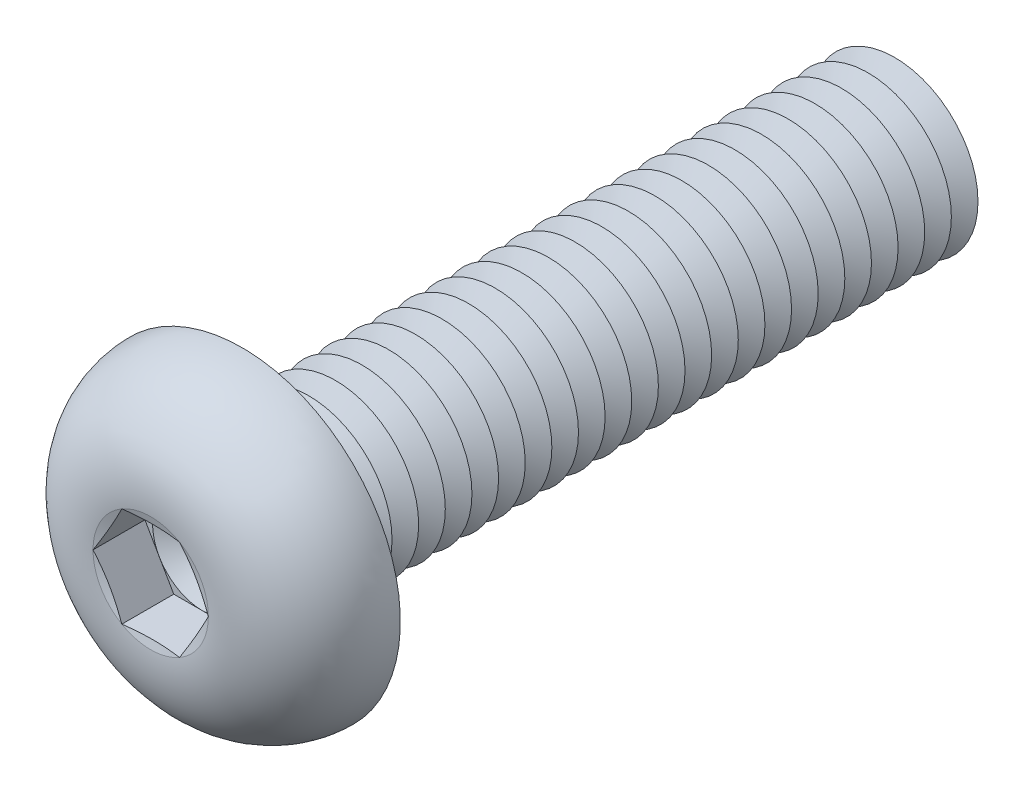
ISO-10303-21;
HEADER;
FILE_DESCRIPTION(('STEP AP214'),'2;1');
FILE_NAME('part.step','',(''),(''),'','','');
FILE_SCHEMA(('AUTOMOTIVE_DESIGN { 1 0 10303 214 1 1 1 1 }'));
ENDSEC;
DATA;
#1=APPLICATION_CONTEXT('core data for automotive mechanical design processes');
#2=APPLICATION_PROTOCOL_DEFINITION('international standard','automotive_design',2000,#1);
#3=PRODUCT_CONTEXT('',#1,'mechanical');
#4=PRODUCT('Part','Part','',(#3));
#5=PRODUCT_RELATED_PRODUCT_CATEGORY('part','',(#4));
#6=PRODUCT_DEFINITION_FORMATION('','',#4);
#7=PRODUCT_DEFINITION_CONTEXT('part definition',#1,'design');
#8=PRODUCT_DEFINITION('design','',#6,#7);
#9=PRODUCT_DEFINITION_SHAPE('','',#8);
#10=(LENGTH_UNIT() NAMED_UNIT(*) SI_UNIT(.MILLI.,.METRE.));
#11=(NAMED_UNIT(*) PLANE_ANGLE_UNIT() SI_UNIT($,.RADIAN.));
#12=(NAMED_UNIT(*) SI_UNIT($,.STERADIAN.) SOLID_ANGLE_UNIT());
#13=UNCERTAINTY_MEASURE_WITH_UNIT(LENGTH_MEASURE(1.E-05),#10,'distance_accuracy_value','');
#14=(GEOMETRIC_REPRESENTATION_CONTEXT(3) GLOBAL_UNCERTAINTY_ASSIGNED_CONTEXT((#13)) GLOBAL_UNIT_ASSIGNED_CONTEXT((#10,
#11,#12)) REPRESENTATION_CONTEXT('',''));
#15=CARTESIAN_POINT('',(0.,0.,0.));
#16=DIRECTION('',(0.,0.,1.));
#17=DIRECTION('',(1.,0.,0.));
#18=AXIS2_PLACEMENT_3D('',#15,#16,#17);
#19=CARTESIAN_POINT('',(0.,0.,1.19));
#20=DIRECTION('',(0.,0.,1.));
#21=DIRECTION('',(1.,0.,0.));
#22=AXIS2_PLACEMENT_3D('',#19,#20,#21);
#23=PLANE('',#22);
#24=CARTESIAN_POINT('',(0.,0.,1.19));
#25=DIRECTION('',(0.,0.,1.));
#26=DIRECTION('',(1.,0.,0.));
#27=AXIS2_PLACEMENT_3D('',#24,#25,#26);
#28=CIRCLE('',#27,1.49999930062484);
#29=CARTESIAN_POINT('',(1.2990375,0.749999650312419,1.19));
#30=VERTEX_POINT('',#29);
#31=CARTESIAN_POINT('',(0.,1.49999930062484,1.19));
#32=VERTEX_POINT('',#31);
#33=EDGE_CURVE('E118',#30,#32,#28,.T.);
#34=ORIENTED_EDGE('',*,*,#33,.F.);
#35=DIRECTION('',(-0.5,0.866025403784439,0.));
#36=VECTOR('',#35,1.);
#37=CARTESIAN_POINT('',(1.73205,0.,1.19));
#38=LINE('',#37,#36);
#39=CARTESIAN_POINT('',(0.866025,1.49999930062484,1.19));
#40=VERTEX_POINT('',#39);
#41=EDGE_CURVE('E125',#30,#40,#38,.T.);
#42=ORIENTED_EDGE('',*,*,#41,.T.);
#43=DIRECTION('',(-1.,0.,0.));
#44=VECTOR('',#43,1.);
#45=CARTESIAN_POINT('',(0.866025,1.49999930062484,1.19));
#46=LINE('',#45,#44);
#47=EDGE_CURVE('E136',#40,#32,#46,.T.);
#48=ORIENTED_EDGE('',*,*,#47,.T.);
#49=EDGE_LOOP('',(#34,#42,#48));
#50=FACE_BOUND('',#49,.T.);
#51=ADVANCED_FACE('F39',(#50),#23,.T.);
#52=CARTESIAN_POINT('',(0.,0.,1.19));
#53=DIRECTION('',(0.,0.,1.));
#54=DIRECTION('',(1.,0.,0.));
#55=AXIS2_PLACEMENT_3D('',#52,#53,#54);
#56=CIRCLE('',#55,1.49999930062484);
#57=CARTESIAN_POINT('',(-1.2990375,0.749999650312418,1.19));
#58=VERTEX_POINT('',#57);
#59=EDGE_CURVE('E11',#32,#58,#56,.T.);
#60=ORIENTED_EDGE('',*,*,#59,.F.);
#61=CARTESIAN_POINT('',(-0.866025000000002,1.49999930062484,1.19));
#62=VERTEX_POINT('',#61);
#63=EDGE_CURVE('E131',#32,#62,#46,.T.);
#64=ORIENTED_EDGE('',*,*,#63,.T.);
#65=DIRECTION('',(-0.5,-0.866025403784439,0.));
#66=VECTOR('',#65,1.);
#67=CARTESIAN_POINT('',(-0.866025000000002,1.49999930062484,1.19));
#68=LINE('',#67,#66);
#69=EDGE_CURVE('E134',#62,#58,#68,.T.);
#70=ORIENTED_EDGE('',*,*,#69,.T.);
#71=EDGE_LOOP('',(#60,#64,#70));
#72=FACE_BOUND('',#71,.T.);
#73=ADVANCED_FACE('F130',(#72),#23,.T.);
#74=CARTESIAN_POINT('',(-1.2990375,-0.749999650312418,1.19));
#75=VERTEX_POINT('',#74);
#76=EDGE_CURVE('E49',#58,#75,#56,.T.);
#77=ORIENTED_EDGE('',*,*,#76,.F.);
#78=CARTESIAN_POINT('',(-1.73205,0.,1.19));
#79=VERTEX_POINT('',#78);
#80=EDGE_CURVE('E143',#58,#79,#68,.T.);
#81=ORIENTED_EDGE('',*,*,#80,.T.);
#82=DIRECTION('',(0.5,-0.866025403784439,0.));
#83=VECTOR('',#82,1.);
#84=CARTESIAN_POINT('',(-1.73205,0.,1.19));
#85=LINE('',#84,#83);
#86=EDGE_CURVE('E152',#79,#75,#85,.T.);
#87=ORIENTED_EDGE('',*,*,#86,.T.);
#88=EDGE_LOOP('',(#77,#81,#87));
#89=FACE_BOUND('',#88,.T.);
#90=ADVANCED_FACE('F467',(#89),#23,.T.);
#91=CARTESIAN_POINT('',(0.,-1.49999930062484,1.19));
#92=VERTEX_POINT('',#91);
#93=EDGE_CURVE('E452',#75,#92,#56,.T.);
#94=ORIENTED_EDGE('',*,*,#93,.F.);
#95=CARTESIAN_POINT('',(-0.866025,-1.49999930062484,1.19));
#96=VERTEX_POINT('',#95);
#97=EDGE_CURVE('E151',#75,#96,#85,.T.);
#98=ORIENTED_EDGE('',*,*,#97,.T.);
#99=DIRECTION('',(1.,0.,0.));
#100=VECTOR('',#99,1.);
#101=CARTESIAN_POINT('',(-0.866025,-1.49999930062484,1.19));
#102=LINE('',#101,#100);
#103=EDGE_CURVE('E157',#96,#92,#102,.T.);
#104=ORIENTED_EDGE('',*,*,#103,.T.);
#105=EDGE_LOOP('',(#94,#98,#104));
#106=FACE_BOUND('',#105,.T.);
#107=ADVANCED_FACE('F460',(#106),#23,.T.);
#108=CARTESIAN_POINT('',(1.2990375,-0.749999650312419,1.19));
#109=VERTEX_POINT('',#108);
#110=EDGE_CURVE('E56',#92,#109,#56,.T.);
#111=ORIENTED_EDGE('',*,*,#110,.F.);
#112=CARTESIAN_POINT('',(0.866025,-1.49999930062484,1.19));
#113=VERTEX_POINT('',#112);
#114=EDGE_CURVE('E156',#92,#113,#102,.T.);
#115=ORIENTED_EDGE('',*,*,#114,.T.);
#116=DIRECTION('',(0.5,0.866025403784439,0.));
#117=VECTOR('',#116,1.);
#118=CARTESIAN_POINT('',(0.866025,-1.49999930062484,1.19));
#119=LINE('',#118,#117);
#120=EDGE_CURVE('E162',#113,#109,#119,.T.);
#121=ORIENTED_EDGE('',*,*,#120,.T.);
#122=EDGE_LOOP('',(#111,#115,#121));
#123=FACE_BOUND('',#122,.T.);
#124=ADVANCED_FACE('F547',(#123),#23,.T.);
#125=CARTESIAN_POINT('',(0.,0.,2.75));
#126=DIRECTION('',(0.,0.,1.));
#127=DIRECTION('',(1.,0.,0.));
#128=AXIS2_PLACEMENT_3D('',#125,#126,#127);
#129=CONICAL_SURFACE('',#128,1.73205,1.30899693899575);
#130=CARTESIAN_POINT('',(1.73216547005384,-0.000200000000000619,2.75003094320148));
#131=CARTESIAN_POINT('',(1.69619207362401,0.0621077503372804,2.74038633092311));
#132=CARTESIAN_POINT('',(1.66015343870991,0.124528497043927,2.73163050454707));
#133=CARTESIAN_POINT('',(1.58794885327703,0.249590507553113,2.71624720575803));
#134=CARTESIAN_POINT('',(1.5517828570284,0.312231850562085,2.70962059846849));
#135=CARTESIAN_POINT('',(1.47954289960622,0.437355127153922,2.69888271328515));
#136=CARTESIAN_POINT('',(1.4434694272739,0.499836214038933,2.69475862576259));
#137=CARTESIAN_POINT('',(1.37127646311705,0.624878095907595,2.68922863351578));
#138=CARTESIAN_POINT('',(1.33515698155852,0.687438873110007,2.68782220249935));
#139=CARTESIAN_POINT('',(1.26291801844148,0.812560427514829,2.68782220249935));
#140=CARTESIAN_POINT('',(1.22679853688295,0.87512120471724,2.68922863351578));
#141=CARTESIAN_POINT('',(1.1546055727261,1.0001630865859,2.69475862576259));
#142=CARTESIAN_POINT('',(1.11853210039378,1.06264417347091,2.69888271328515));
#143=CARTESIAN_POINT('',(1.0462921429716,1.18776745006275,2.70962059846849));
#144=CARTESIAN_POINT('',(1.01012614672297,1.25040879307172,2.71624720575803));
#145=CARTESIAN_POINT('',(0.937921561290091,1.37547080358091,2.73163050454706));
#146=CARTESIAN_POINT('',(0.901882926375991,1.43789155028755,2.74038633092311));
#147=CARTESIAN_POINT('',(0.865909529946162,1.50019930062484,2.75003094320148));
#148=B_SPLINE_CURVE_WITH_KNOTS('',3,(#130,#131,#132,#133,#134,#135,#136,#137,#138,#139,#140,
#141,#142,#143,#144,#145,#146,#147),.UNSPECIFIED.,.F.,.F.,(4,2,2,2,2,2,2,2,4),(0.,
0.217782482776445,0.435653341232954,0.652399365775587,0.869103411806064,1.08580745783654,
1.30255348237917,1.52042434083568,1.73820682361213),.UNSPECIFIED.);
#149=CARTESIAN_POINT('',(1.73205,0.,2.75));
#150=VERTEX_POINT('',#149);
#151=CARTESIAN_POINT('',(0.866025,1.49999930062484,2.75));
#152=VERTEX_POINT('',#151);
#153=EDGE_CURVE('E220',#150,#152,#148,.T.);
#154=ORIENTED_EDGE('',*,*,#153,.F.);
#155=CARTESIAN_POINT('',(0.,0.,2.75));
#156=DIRECTION('',(0.,0.,-1.));
#157=DIRECTION('',(-1.,0.,0.));
#158=AXIS2_PLACEMENT_3D('',#155,#156,#157);
#159=CIRCLE('',#158,1.73205);
#160=EDGE_CURVE('E498',#152,#150,#159,.T.);
#161=ORIENTED_EDGE('',*,*,#160,.F.);
#162=EDGE_LOOP('',(#154,#161));
#163=FACE_BOUND('',#162,.T.);
#164=ADVANCED_FACE('F512',(#163),#129,.F.);
#165=CARTESIAN_POINT('',(0.865909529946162,-1.50019930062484,2.75003094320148));
#166=CARTESIAN_POINT('',(0.901882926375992,-1.43789155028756,2.74038633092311));
#167=CARTESIAN_POINT('',(0.937921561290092,-1.37547080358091,2.73163050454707));
#168=CARTESIAN_POINT('',(1.01012614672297,-1.25040879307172,2.71624720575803));
#169=CARTESIAN_POINT('',(1.0462921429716,-1.18776745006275,2.70962059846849));
#170=CARTESIAN_POINT('',(1.11853210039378,-1.06264417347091,2.69888271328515));
#171=CARTESIAN_POINT('',(1.1546055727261,-1.0001630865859,2.69475862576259));
#172=CARTESIAN_POINT('',(1.22679853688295,-0.875121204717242,2.68922863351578));
#173=CARTESIAN_POINT('',(1.26291801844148,-0.81256042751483,2.68782220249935));
#174=CARTESIAN_POINT('',(1.33515698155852,-0.687438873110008,2.68782220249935));
#175=CARTESIAN_POINT('',(1.37127646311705,-0.624878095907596,2.68922863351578));
#176=CARTESIAN_POINT('',(1.4434694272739,-0.499836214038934,2.69475862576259));
#177=CARTESIAN_POINT('',(1.47954289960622,-0.437355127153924,2.69888271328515));
#178=CARTESIAN_POINT('',(1.5517828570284,-0.312231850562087,2.70962059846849));
#179=CARTESIAN_POINT('',(1.58794885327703,-0.249590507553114,2.71624720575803));
#180=CARTESIAN_POINT('',(1.66015343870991,-0.124528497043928,2.73163050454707));
#181=CARTESIAN_POINT('',(1.69619207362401,-0.0621077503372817,2.74038633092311));
#182=CARTESIAN_POINT('',(1.73216547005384,0.000199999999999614,2.75003094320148));
#183=B_SPLINE_CURVE_WITH_KNOTS('',3,(#165,#166,#167,#168,#169,#170,#171,#172,#173,#174,#175,
#176,#177,#178,#179,#180,#181,#182),.UNSPECIFIED.,.F.,.F.,(4,2,2,2,2,2,2,2,4),(0.,
0.217782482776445,0.435653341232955,0.652399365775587,0.869103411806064,1.08580745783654,
1.30255348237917,1.52042434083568,1.73820682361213),.UNSPECIFIED.);
#184=CARTESIAN_POINT('',(0.866025,-1.49999930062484,2.75));
#185=VERTEX_POINT('',#184);
#186=EDGE_CURVE('E229',#185,#150,#183,.T.);
#187=ORIENTED_EDGE('',*,*,#186,.F.);
#188=EDGE_CURVE('E500',#150,#185,#159,.T.);
#189=ORIENTED_EDGE('',*,*,#188,.F.);
#190=EDGE_LOOP('',(#187,#189));
#191=FACE_BOUND('',#190,.T.);
#192=ADVANCED_FACE('F515',(#191),#129,.F.);
#193=CARTESIAN_POINT('',(-2.61375031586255,-1.49999930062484,3.09338600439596));
#194=CARTESIAN_POINT('',(-2.48719895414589,-1.49999930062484,3.06401688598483));
#195=CARTESIAN_POINT('',(-2.36054180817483,-1.49999930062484,3.03507426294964));
#196=CARTESIAN_POINT('',(-2.10688190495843,-1.49999930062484,2.97862489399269));
#197=CARTESIAN_POINT('',(-1.97987908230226,-1.49999930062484,2.95111844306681));
#198=CARTESIAN_POINT('',(-1.72425281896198,-1.49999930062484,2.89788845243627));
#199=CARTESIAN_POINT('',(-1.59562534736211,-1.49999930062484,2.87218404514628));
#200=CARTESIAN_POINT('',(-1.33776732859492,-1.49999930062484,2.82387586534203));
#201=CARTESIAN_POINT('',(-1.20853672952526,-1.49999930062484,2.80127236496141));
#202=CARTESIAN_POINT('',(-0.952831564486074,-1.49999930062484,2.76126658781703));
#203=CARTESIAN_POINT('',(-0.826376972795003,-1.49999930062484,2.74374018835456));
#204=CARTESIAN_POINT('',(-0.572755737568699,-1.49999930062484,2.71502809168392));
#205=CARTESIAN_POINT('',(-0.445589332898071,-1.49999930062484,2.70384038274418));
#206=CARTESIAN_POINT('',(-0.191333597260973,-1.49999930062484,2.68972083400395));
#207=CARTESIAN_POINT('',(-0.0642464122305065,-1.49999930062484,2.68675270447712));
#208=CARTESIAN_POINT('',(0.189835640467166,-1.49999930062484,2.68959577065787));
#209=CARTESIAN_POINT('',(0.31683049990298,-1.49999930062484,2.69540767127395));
#210=CARTESIAN_POINT('',(0.53418249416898,-1.49999930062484,2.71190493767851));
#211=CARTESIAN_POINT('',(0.624691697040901,-1.49999930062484,2.72073513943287));
#212=CARTESIAN_POINT('',(0.805336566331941,-1.49999930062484,2.74156379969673));
#213=CARTESIAN_POINT('',(0.895472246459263,-1.49999930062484,2.75356214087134));
#214=CARTESIAN_POINT('',(1.0756572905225,-1.49999930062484,2.78006977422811));
#215=CARTESIAN_POINT('',(1.16570548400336,-1.49999930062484,2.7945868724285));
#216=CARTESIAN_POINT('',(1.3454787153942,-1.49999930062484,2.82550612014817));
#217=CARTESIAN_POINT('',(1.43520373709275,-1.49999930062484,2.8419083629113));
#218=CARTESIAN_POINT('',(1.61622412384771,-1.49999930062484,2.87648604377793));
#219=CARTESIAN_POINT('',(1.70751379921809,-1.49999930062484,2.89469103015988));
#220=CARTESIAN_POINT('',(1.88986344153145,-1.49999930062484,2.93221618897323));
#221=CARTESIAN_POINT('',(1.98092340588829,-1.49999930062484,2.95153637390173));
#222=CARTESIAN_POINT('',(2.16236354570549,-1.49999930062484,2.99091506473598));
#223=CARTESIAN_POINT('',(2.25274472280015,-1.49999930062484,3.01096897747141));
#224=CARTESIAN_POINT('',(2.43335289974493,-1.49999930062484,3.05173139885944));
#225=CARTESIAN_POINT('',(2.52357990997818,-1.49999930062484,3.07243986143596));
#226=CARTESIAN_POINT('',(2.61375031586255,-1.49999930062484,3.09338600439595));
#227=B_SPLINE_CURVE_WITH_KNOTS('',3,(#193,#194,#195,#196,#197,#198,#199,#200,#201,#202,#203,
#204,#205,#206,#207,#208,#209,#210,#211,#212,#213,#214,#215,#216,#217,#218,#219,#220,#221,#222,
#223,#224,#225,#226),.UNSPECIFIED.,.F.,.F.,(4,2,2,2,2,2,2,2,2,2,2,2,2,2,2,2,4),(0.,
0.389753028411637,0.779585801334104,1.17307326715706,1.5665952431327,1.94947555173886,
2.33223427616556,2.71330039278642,3.09439710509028,3.36715350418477,3.63989980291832,
3.91350699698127,4.18712773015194,4.4663802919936,4.74563598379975,5.02337106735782,
5.3010866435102),.UNSPECIFIED.);
#228=CARTESIAN_POINT('',(-0.866025,-1.49999930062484,2.75));
#229=VERTEX_POINT('',#228);
#230=EDGE_CURVE('E479',#229,#185,#227,.T.);
#231=ORIENTED_EDGE('',*,*,#230,.F.);
#232=EDGE_CURVE('E487',#185,#229,#159,.T.);
#233=ORIENTED_EDGE('',*,*,#232,.F.);
#234=EDGE_LOOP('',(#231,#233));
#235=FACE_BOUND('',#234,.T.);
#236=ADVANCED_FACE('F520',(#235),#129,.F.);
#237=CARTESIAN_POINT('',(-1.73216547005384,0.000200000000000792,2.75003094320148));
#238=CARTESIAN_POINT('',(-1.69619207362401,-0.0621077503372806,2.74038633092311));
#239=CARTESIAN_POINT('',(-1.66015343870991,-0.124528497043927,2.73163050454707));
#240=CARTESIAN_POINT('',(-1.58794885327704,-0.249590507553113,2.71624720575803));
#241=CARTESIAN_POINT('',(-1.55178285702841,-0.312231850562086,2.70962059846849));
#242=CARTESIAN_POINT('',(-1.47954289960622,-0.437355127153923,2.69888271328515));
#243=CARTESIAN_POINT('',(-1.4434694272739,-0.499836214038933,2.69475862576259));
#244=CARTESIAN_POINT('',(-1.37127646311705,-0.624878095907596,2.68922863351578));
#245=CARTESIAN_POINT('',(-1.33515698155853,-0.687438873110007,2.68782220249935));
#246=CARTESIAN_POINT('',(-1.26291801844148,-0.81256042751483,2.68782220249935));
#247=CARTESIAN_POINT('',(-1.22679853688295,-0.875121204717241,2.68922863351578));
#248=CARTESIAN_POINT('',(-1.1546055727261,-1.0001630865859,2.69475862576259));
#249=CARTESIAN_POINT('',(-1.11853210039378,-1.06264417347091,2.69888271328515));
#250=CARTESIAN_POINT('',(-1.0462921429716,-1.18776745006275,2.70962059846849));
#251=CARTESIAN_POINT('',(-1.01012614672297,-1.25040879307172,2.71624720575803));
#252=CARTESIAN_POINT('',(-0.937921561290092,-1.37547080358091,2.73163050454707));
#253=CARTESIAN_POINT('',(-0.901882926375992,-1.43789155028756,2.74038633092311));
#254=CARTESIAN_POINT('',(-0.865909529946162,-1.50019930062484,2.75003094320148));
#255=B_SPLINE_CURVE_WITH_KNOTS('',3,(#237,#238,#239,#240,#241,#242,#243,#244,#245,#246,#247,
#248,#249,#250,#251,#252,#253,#254),.UNSPECIFIED.,.F.,.F.,(4,2,2,2,2,2,2,2,4),(0.,
0.217782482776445,0.435653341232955,0.652399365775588,0.869103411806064,1.08580745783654,
1.30255348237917,1.52042434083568,1.73820682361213),.UNSPECIFIED.);
#256=CARTESIAN_POINT('',(-1.73205,0.,2.75));
#257=VERTEX_POINT('',#256);
#258=EDGE_CURVE('E472',#257,#229,#255,.T.);
#259=ORIENTED_EDGE('',*,*,#258,.F.);
#260=EDGE_CURVE('E434',#229,#257,#159,.T.);
#261=ORIENTED_EDGE('',*,*,#260,.F.);
#262=EDGE_LOOP('',(#259,#261));
#263=FACE_BOUND('',#262,.T.);
#264=ADVANCED_FACE('F476',(#263),#129,.F.);
#265=CARTESIAN_POINT('',(-0.865909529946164,1.50019930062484,2.75003094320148));
#266=CARTESIAN_POINT('',(-0.901882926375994,1.43789155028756,2.74038633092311));
#267=CARTESIAN_POINT('',(-0.937921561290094,1.37547080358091,2.73163050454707));
#268=CARTESIAN_POINT('',(-1.01012614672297,1.25040879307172,2.71624720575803));
#269=CARTESIAN_POINT('',(-1.0462921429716,1.18776745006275,2.70962059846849));
#270=CARTESIAN_POINT('',(-1.11853210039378,1.06264417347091,2.69888271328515));
#271=CARTESIAN_POINT('',(-1.1546055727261,1.0001630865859,2.69475862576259));
#272=CARTESIAN_POINT('',(-1.22679853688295,0.875121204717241,2.68922863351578));
#273=CARTESIAN_POINT('',(-1.26291801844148,0.81256042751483,2.68782220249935));
#274=CARTESIAN_POINT('',(-1.33515698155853,0.687438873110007,2.68782220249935));
#275=CARTESIAN_POINT('',(-1.37127646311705,0.624878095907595,2.68922863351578));
#276=CARTESIAN_POINT('',(-1.4434694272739,0.499836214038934,2.69475862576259));
#277=CARTESIAN_POINT('',(-1.47954289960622,0.437355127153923,2.69888271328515));
#278=CARTESIAN_POINT('',(-1.55178285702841,0.312231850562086,2.70962059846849));
#279=CARTESIAN_POINT('',(-1.58794885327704,0.249590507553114,2.71624720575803));
#280=CARTESIAN_POINT('',(-1.66015343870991,0.124528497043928,2.73163050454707));
#281=CARTESIAN_POINT('',(-1.69619207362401,0.0621077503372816,2.74038633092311));
#282=CARTESIAN_POINT('',(-1.73216547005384,-0.000199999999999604,2.75003094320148));
#283=B_SPLINE_CURVE_WITH_KNOTS('',3,(#265,#266,#267,#268,#269,#270,#271,#272,#273,#274,#275,
#276,#277,#278,#279,#280,#281,#282),.UNSPECIFIED.,.F.,.F.,(4,2,2,2,2,2,2,2,4),(0.,
0.217782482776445,0.435653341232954,0.652399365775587,0.869103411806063,1.08580745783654,
1.30255348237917,1.52042434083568,1.73820682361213),.UNSPECIFIED.);
#284=CARTESIAN_POINT('',(-0.866025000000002,1.49999930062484,2.75));
#285=VERTEX_POINT('',#284);
#286=EDGE_CURVE('E194',#285,#257,#283,.T.);
#287=ORIENTED_EDGE('',*,*,#286,.F.);
#288=EDGE_CURVE('E435',#257,#285,#159,.T.);
#289=ORIENTED_EDGE('',*,*,#288,.F.);
#290=EDGE_LOOP('',(#287,#289));
#291=FACE_BOUND('',#290,.T.);
#292=ADVANCED_FACE('F490',(#291),#129,.F.);
#293=CARTESIAN_POINT('',(0.,0.,-17.2));
#294=DIRECTION('',(0.,0.,1.));
#295=DIRECTION('',(1.,0.,0.));
#296=AXIS2_PLACEMENT_3D('',#293,#294,#295);
#297=CONICAL_SURFACE('',#296,2.50000000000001,1.0471975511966);
#298=CARTESIAN_POINT('',(0.,0.,-17.6));
#299=DIRECTION('',(0.,0.,1.));
#300=DIRECTION('',(1.,0.,0.));
#301=AXIS2_PLACEMENT_3D('',#298,#299,#300);
#302=CIRCLE('',#301,1.80717967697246);
#303=CARTESIAN_POINT('',(1.80717967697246,0.,-17.6));
#304=VERTEX_POINT('',#303);
#305=EDGE_CURVE('E407',#304,#304,#302,.T.);
#306=ORIENTED_EDGE('',*,*,#305,.T.);
#307=EDGE_LOOP('',(#306));
#308=FACE_BOUND('',#307,.T.);
#309=CARTESIAN_POINT('',(0.,0.,-17.2));
#310=DIRECTION('',(0.,0.,1.));
#311=DIRECTION('',(1.,0.,0.));
#312=AXIS2_PLACEMENT_3D('',#309,#310,#311);
#313=CIRCLE('',#312,2.50000000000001);
#314=CARTESIAN_POINT('',(2.50000000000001,0.,-17.2));
#315=VERTEX_POINT('',#314);
#316=EDGE_CURVE('E403',#315,#315,#313,.T.);
#317=ORIENTED_EDGE('',*,*,#316,.F.);
#318=EDGE_LOOP('',(#317));
#319=FACE_BOUND('',#318,.T.);
#320=ADVANCED_FACE('F678',(#308,#319),#297,.T.);
#321=CARTESIAN_POINT('',(0.,0.,-17.6));
#322=DIRECTION('',(0.,0.,-1.));
#323=DIRECTION('',(-1.,0.,0.));
#324=AXIS2_PLACEMENT_3D('',#321,#322,#323);
#325=CONICAL_SURFACE('',#324,1.80717967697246,1.0471975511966);
#326=CARTESIAN_POINT('',(0.,0.,-18.));
#327=DIRECTION('',(0.,0.,1.));
#328=DIRECTION('',(1.,0.,0.));
#329=AXIS2_PLACEMENT_3D('',#326,#327,#328);
#330=CIRCLE('',#329,2.50000000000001);
#331=CARTESIAN_POINT('',(2.50000000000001,0.,-18.));
#332=VERTEX_POINT('',#331);
#333=EDGE_CURVE('E411',#332,#332,#330,.T.);
#334=ORIENTED_EDGE('',*,*,#333,.T.);
#335=EDGE_LOOP('',(#334));
#336=FACE_BOUND('',#335,.T.);
#337=ORIENTED_EDGE('',*,*,#305,.F.);
#338=EDGE_LOOP('',(#337));
#339=FACE_BOUND('',#338,.T.);
#340=ADVANCED_FACE('F1140',(#336,#339),#325,.T.);
#341=CARTESIAN_POINT('',(0.,2.50000000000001,-20.));
#342=DIRECTION('',(0.,0.,-1.));
#343=DIRECTION('',(-1.,0.,0.));
#344=AXIS2_PLACEMENT_3D('',#341,#342,#343);
#345=PLANE('',#344);
#346=CARTESIAN_POINT('',(0.,0.,-20.));
#347=DIRECTION('',(0.,0.,1.));
#348=DIRECTION('',(1.,0.,0.));
#349=AXIS2_PLACEMENT_3D('',#346,#347,#348);
#350=CIRCLE('',#349,1.80717967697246);
#351=CARTESIAN_POINT('',(1.80717967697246,0.,-20.));
#352=VERTEX_POINT('',#351);
#353=EDGE_CURVE('E430',#352,#352,#350,.T.);
#354=ORIENTED_EDGE('',*,*,#353,.F.);
#355=EDGE_LOOP('',(#354));
#356=FACE_BOUND('',#355,.T.);
#357=ADVANCED_FACE('F1145',(#356),#345,.T.);
#358=CARTESIAN_POINT('',(0.,0.,-19.6));
#359=DIRECTION('',(0.,0.,1.));
#360=DIRECTION('',(1.,0.,0.));
#361=AXIS2_PLACEMENT_3D('',#358,#359,#360);
#362=CONICAL_SURFACE('',#361,2.50000000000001,1.0471975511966);
#363=ORIENTED_EDGE('',*,*,#353,.T.);
#364=EDGE_LOOP('',(#363));
#365=FACE_BOUND('',#364,.T.);
#366=CARTESIAN_POINT('',(0.,0.,-19.6));
#367=DIRECTION('',(0.,0.,1.));
#368=DIRECTION('',(1.,0.,0.));
#369=AXIS2_PLACEMENT_3D('',#366,#367,#368);
#370=CIRCLE('',#369,2.50000000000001);
#371=CARTESIAN_POINT('',(2.50000000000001,0.,-19.6));
#372=VERTEX_POINT('',#371);
#373=EDGE_CURVE('E427',#372,#372,#370,.T.);
#374=ORIENTED_EDGE('',*,*,#373,.F.);
#375=EDGE_LOOP('',(#374));
#376=FACE_BOUND('',#375,.T.);
#377=ADVANCED_FACE('F1134',(#365,#376),#362,.T.);
#378=CARTESIAN_POINT('',(0.,0.,-19.2));
#379=DIRECTION('',(0.,0.,-1.));
#380=DIRECTION('',(-1.,0.,0.));
#381=AXIS2_PLACEMENT_3D('',#378,#379,#380);
#382=CONICAL_SURFACE('',#381,1.80717967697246,1.0471975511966);
#383=ORIENTED_EDGE('',*,*,#373,.T.);
#384=EDGE_LOOP('',(#383));
#385=FACE_BOUND('',#384,.T.);
#386=CARTESIAN_POINT('',(0.,0.,-19.2));
#387=DIRECTION('',(0.,0.,1.));
#388=DIRECTION('',(1.,0.,0.));
#389=AXIS2_PLACEMENT_3D('',#386,#387,#388);
#390=CIRCLE('',#389,1.80717967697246);
#391=CARTESIAN_POINT('',(1.80717967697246,0.,-19.2));
#392=VERTEX_POINT('',#391);
#393=EDGE_CURVE('E423',#392,#392,#390,.T.);
#394=ORIENTED_EDGE('',*,*,#393,.F.);
#395=EDGE_LOOP('',(#394));
#396=FACE_BOUND('',#395,.T.);
#397=ADVANCED_FACE('F1124',(#385,#396),#382,.T.);
#398=CARTESIAN_POINT('',(0.,0.,-18.8));
#399=DIRECTION('',(0.,0.,1.));
#400=DIRECTION('',(1.,0.,0.));
#401=AXIS2_PLACEMENT_3D('',#398,#399,#400);
#402=CONICAL_SURFACE('',#401,2.50000000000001,1.0471975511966);
#403=ORIENTED_EDGE('',*,*,#393,.T.);
#404=EDGE_LOOP('',(#403));
#405=FACE_BOUND('',#404,.T.);
#406=CARTESIAN_POINT('',(0.,0.,-18.8));
#407=DIRECTION('',(0.,0.,1.));
#408=DIRECTION('',(1.,0.,0.));
#409=AXIS2_PLACEMENT_3D('',#406,#407,#408);
#410=CIRCLE('',#409,2.50000000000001);
#411=CARTESIAN_POINT('',(2.50000000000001,0.,-18.8));
#412=VERTEX_POINT('',#411);
#413=EDGE_CURVE('E419',#412,#412,#410,.T.);
#414=ORIENTED_EDGE('',*,*,#413,.F.);
#415=EDGE_LOOP('',(#414));
#416=FACE_BOUND('',#415,.T.);
#417=ADVANCED_FACE('F1114',(#405,#416),#402,.T.);
#418=CARTESIAN_POINT('',(0.,0.,-18.4));
#419=DIRECTION('',(0.,0.,-1.));
#420=DIRECTION('',(-1.,0.,0.));
#421=AXIS2_PLACEMENT_3D('',#418,#419,#420);
#422=CONICAL_SURFACE('',#421,1.80717967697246,1.0471975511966);
#423=ORIENTED_EDGE('',*,*,#413,.T.);
#424=EDGE_LOOP('',(#423));
#425=FACE_BOUND('',#424,.T.);
#426=CARTESIAN_POINT('',(0.,0.,-18.4));
#427=DIRECTION('',(0.,0.,1.));
#428=DIRECTION('',(1.,0.,0.));
#429=AXIS2_PLACEMENT_3D('',#426,#427,#428);
#430=CIRCLE('',#429,1.80717967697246);
#431=CARTESIAN_POINT('',(1.80717967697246,0.,-18.4));
#432=VERTEX_POINT('',#431);
#433=EDGE_CURVE('E415',#432,#432,#430,.T.);
#434=ORIENTED_EDGE('',*,*,#433,.F.);
#435=EDGE_LOOP('',(#434));
#436=FACE_BOUND('',#435,.T.);
#437=ADVANCED_FACE('F1104',(#425,#436),#422,.T.);
#438=CARTESIAN_POINT('',(0.,0.,-18.));
#439=DIRECTION('',(0.,0.,1.));
#440=DIRECTION('',(1.,0.,0.));
#441=AXIS2_PLACEMENT_3D('',#438,#439,#440);
#442=CONICAL_SURFACE('',#441,2.50000000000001,1.0471975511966);
#443=ORIENTED_EDGE('',*,*,#433,.T.);
#444=EDGE_LOOP('',(#443));
#445=FACE_BOUND('',#444,.T.);
#446=ORIENTED_EDGE('',*,*,#333,.F.);
#447=EDGE_LOOP('',(#446));
#448=FACE_BOUND('',#447,.T.);
#449=ADVANCED_FACE('F1094',(#445,#448),#442,.T.);
#450=CARTESIAN_POINT('',(0.,0.,-16.4));
#451=DIRECTION('',(0.,0.,1.));
#452=DIRECTION('',(1.,0.,0.));
#453=AXIS2_PLACEMENT_3D('',#450,#451,#452);
#454=CONICAL_SURFACE('',#453,2.50000000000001,1.0471975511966);
#455=CARTESIAN_POINT('',(0.,0.,-16.8));
#456=DIRECTION('',(0.,0.,1.));
#457=DIRECTION('',(1.,0.,0.));
#458=AXIS2_PLACEMENT_3D('',#455,#456,#457);
#459=CIRCLE('',#458,1.80717967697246);
#460=CARTESIAN_POINT('',(1.80717967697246,0.,-16.8));
#461=VERTEX_POINT('',#460);
#462=EDGE_CURVE('E399',#461,#461,#459,.T.);
#463=ORIENTED_EDGE('',*,*,#462,.T.);
#464=EDGE_LOOP('',(#463));
#465=FACE_BOUND('',#464,.T.);
#466=CARTESIAN_POINT('',(0.,0.,-16.4));
#467=DIRECTION('',(0.,0.,1.));
#468=DIRECTION('',(1.,0.,0.));
#469=AXIS2_PLACEMENT_3D('',#466,#467,#468);
#470=CIRCLE('',#469,2.50000000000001);
#471=CARTESIAN_POINT('',(2.50000000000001,0.,-16.4));
#472=VERTEX_POINT('',#471);
#473=EDGE_CURVE('E395',#472,#472,#470,.T.);
#474=ORIENTED_EDGE('',*,*,#473,.F.);
#475=EDGE_LOOP('',(#474));
#476=FACE_BOUND('',#475,.T.);
#477=ADVANCED_FACE('F1084',(#465,#476),#454,.T.);
#478=CARTESIAN_POINT('',(0.,0.,-16.8));
#479=DIRECTION('',(0.,0.,-1.));
#480=DIRECTION('',(-1.,0.,0.));
#481=AXIS2_PLACEMENT_3D('',#478,#479,#480);
#482=CONICAL_SURFACE('',#481,1.80717967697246,1.0471975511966);
#483=ORIENTED_EDGE('',*,*,#316,.T.);
#484=EDGE_LOOP('',(#483));
#485=FACE_BOUND('',#484,.T.);
#486=ORIENTED_EDGE('',*,*,#462,.F.);
#487=EDGE_LOOP('',(#486));
#488=FACE_BOUND('',#487,.T.);
#489=ADVANCED_FACE('F1074',(#485,#488),#482,.T.);
#490=CARTESIAN_POINT('',(0.,0.,-15.6));
#491=DIRECTION('',(0.,0.,1.));
#492=DIRECTION('',(1.,0.,0.));
#493=AXIS2_PLACEMENT_3D('',#490,#491,#492);
#494=CONICAL_SURFACE('',#493,2.50000000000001,1.0471975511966);
#495=CARTESIAN_POINT('',(0.,0.,-16.));
#496=DIRECTION('',(0.,0.,1.));
#497=DIRECTION('',(1.,0.,0.));
#498=AXIS2_PLACEMENT_3D('',#495,#496,#497);
#499=CIRCLE('',#498,1.80717967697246);
#500=CARTESIAN_POINT('',(1.80717967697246,0.,-16.));
#501=VERTEX_POINT('',#500);
#502=EDGE_CURVE('E391',#501,#501,#499,.T.);
#503=ORIENTED_EDGE('',*,*,#502,.T.);
#504=EDGE_LOOP('',(#503));
#505=FACE_BOUND('',#504,.T.);
#506=CARTESIAN_POINT('',(0.,0.,-15.6));
#507=DIRECTION('',(0.,0.,1.));
#508=DIRECTION('',(1.,0.,0.));
#509=AXIS2_PLACEMENT_3D('',#506,#507,#508);
#510=CIRCLE('',#509,2.50000000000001);
#511=CARTESIAN_POINT('',(2.50000000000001,0.,-15.6));
#512=VERTEX_POINT('',#511);
#513=EDGE_CURVE('E387',#512,#512,#510,.T.);
#514=ORIENTED_EDGE('',*,*,#513,.F.);
#515=EDGE_LOOP('',(#514));
#516=FACE_BOUND('',#515,.T.);
#517=ADVANCED_FACE('F1064',(#505,#516),#494,.T.);
#518=CARTESIAN_POINT('',(0.,0.,-16.));
#519=DIRECTION('',(0.,0.,-1.));
#520=DIRECTION('',(-1.,0.,0.));
#521=AXIS2_PLACEMENT_3D('',#518,#519,#520);
#522=CONICAL_SURFACE('',#521,1.80717967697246,1.0471975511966);
#523=ORIENTED_EDGE('',*,*,#473,.T.);
#524=EDGE_LOOP('',(#523));
#525=FACE_BOUND('',#524,.T.);
#526=ORIENTED_EDGE('',*,*,#502,.F.);
#527=EDGE_LOOP('',(#526));
#528=FACE_BOUND('',#527,.T.);
#529=ADVANCED_FACE('F1054',(#525,#528),#522,.T.);
#530=CARTESIAN_POINT('',(0.,0.,-14.8));
#531=DIRECTION('',(0.,0.,1.));
#532=DIRECTION('',(1.,0.,0.));
#533=AXIS2_PLACEMENT_3D('',#530,#531,#532);
#534=CONICAL_SURFACE('',#533,2.50000000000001,1.0471975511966);
#535=CARTESIAN_POINT('',(0.,0.,-15.2));
#536=DIRECTION('',(0.,0.,1.));
#537=DIRECTION('',(1.,0.,0.));
#538=AXIS2_PLACEMENT_3D('',#535,#536,#537);
#539=CIRCLE('',#538,1.80717967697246);
#540=CARTESIAN_POINT('',(1.80717967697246,0.,-15.2));
#541=VERTEX_POINT('',#540);
#542=EDGE_CURVE('E383',#541,#541,#539,.T.);
#543=ORIENTED_EDGE('',*,*,#542,.T.);
#544=EDGE_LOOP('',(#543));
#545=FACE_BOUND('',#544,.T.);
#546=CARTESIAN_POINT('',(0.,0.,-14.8));
#547=DIRECTION('',(0.,0.,1.));
#548=DIRECTION('',(1.,0.,0.));
#549=AXIS2_PLACEMENT_3D('',#546,#547,#548);
#550=CIRCLE('',#549,2.50000000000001);
#551=CARTESIAN_POINT('',(2.50000000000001,0.,-14.8));
#552=VERTEX_POINT('',#551);
#553=EDGE_CURVE('E379',#552,#552,#550,.T.);
#554=ORIENTED_EDGE('',*,*,#553,.F.);
#555=EDGE_LOOP('',(#554));
#556=FACE_BOUND('',#555,.T.);
#557=ADVANCED_FACE('F1044',(#545,#556),#534,.T.);
#558=CARTESIAN_POINT('',(0.,0.,-15.2));
#559=DIRECTION('',(0.,0.,-1.));
#560=DIRECTION('',(-1.,0.,0.));
#561=AXIS2_PLACEMENT_3D('',#558,#559,#560);
#562=CONICAL_SURFACE('',#561,1.80717967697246,1.0471975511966);
#563=ORIENTED_EDGE('',*,*,#513,.T.);
#564=EDGE_LOOP('',(#563));
#565=FACE_BOUND('',#564,.T.);
#566=ORIENTED_EDGE('',*,*,#542,.F.);
#567=EDGE_LOOP('',(#566));
#568=FACE_BOUND('',#567,.T.);
#569=ADVANCED_FACE('F1034',(#565,#568),#562,.T.);
#570=CARTESIAN_POINT('',(0.,0.,-14.));
#571=DIRECTION('',(0.,0.,1.));
#572=DIRECTION('',(1.,0.,0.));
#573=AXIS2_PLACEMENT_3D('',#570,#571,#572);
#574=CONICAL_SURFACE('',#573,2.50000000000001,1.0471975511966);
#575=CARTESIAN_POINT('',(0.,0.,-14.4));
#576=DIRECTION('',(0.,0.,1.));
#577=DIRECTION('',(1.,0.,0.));
#578=AXIS2_PLACEMENT_3D('',#575,#576,#577);
#579=CIRCLE('',#578,1.80717967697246);
#580=CARTESIAN_POINT('',(1.80717967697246,0.,-14.4));
#581=VERTEX_POINT('',#580);
#582=EDGE_CURVE('E375',#581,#581,#579,.T.);
#583=ORIENTED_EDGE('',*,*,#582,.T.);
#584=EDGE_LOOP('',(#583));
#585=FACE_BOUND('',#584,.T.);
#586=CARTESIAN_POINT('',(0.,0.,-14.));
#587=DIRECTION('',(0.,0.,1.));
#588=DIRECTION('',(1.,0.,0.));
#589=AXIS2_PLACEMENT_3D('',#586,#587,#588);
#590=CIRCLE('',#589,2.50000000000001);
#591=CARTESIAN_POINT('',(2.50000000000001,0.,-14.));
#592=VERTEX_POINT('',#591);
#593=EDGE_CURVE('E371',#592,#592,#590,.T.);
#594=ORIENTED_EDGE('',*,*,#593,.F.);
#595=EDGE_LOOP('',(#594));
#596=FACE_BOUND('',#595,.T.);
#597=ADVANCED_FACE('F1024',(#585,#596),#574,.T.);
#598=CARTESIAN_POINT('',(0.,0.,-14.4));
#599=DIRECTION('',(0.,0.,-1.));
#600=DIRECTION('',(-1.,0.,0.));
#601=AXIS2_PLACEMENT_3D('',#598,#599,#600);
#602=CONICAL_SURFACE('',#601,1.80717967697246,1.0471975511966);
#603=ORIENTED_EDGE('',*,*,#553,.T.);
#604=EDGE_LOOP('',(#603));
#605=FACE_BOUND('',#604,.T.);
#606=ORIENTED_EDGE('',*,*,#582,.F.);
#607=EDGE_LOOP('',(#606));
#608=FACE_BOUND('',#607,.T.);
#609=ADVANCED_FACE('F1014',(#605,#608),#602,.T.);
#610=CARTESIAN_POINT('',(0.,0.,-13.2));
#611=DIRECTION('',(0.,0.,1.));
#612=DIRECTION('',(1.,0.,0.));
#613=AXIS2_PLACEMENT_3D('',#610,#611,#612);
#614=CONICAL_SURFACE('',#613,2.50000000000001,1.0471975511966);
#615=CARTESIAN_POINT('',(0.,0.,-13.6));
#616=DIRECTION('',(0.,0.,1.));
#617=DIRECTION('',(1.,0.,0.));
#618=AXIS2_PLACEMENT_3D('',#615,#616,#617);
#619=CIRCLE('',#618,1.80717967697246);
#620=CARTESIAN_POINT('',(1.80717967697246,0.,-13.6));
#621=VERTEX_POINT('',#620);
#622=EDGE_CURVE('E367',#621,#621,#619,.T.);
#623=ORIENTED_EDGE('',*,*,#622,.T.);
#624=EDGE_LOOP('',(#623));
#625=FACE_BOUND('',#624,.T.);
#626=CARTESIAN_POINT('',(0.,0.,-13.2));
#627=DIRECTION('',(0.,0.,1.));
#628=DIRECTION('',(1.,0.,0.));
#629=AXIS2_PLACEMENT_3D('',#626,#627,#628);
#630=CIRCLE('',#629,2.50000000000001);
#631=CARTESIAN_POINT('',(2.50000000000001,0.,-13.2));
#632=VERTEX_POINT('',#631);
#633=EDGE_CURVE('E363',#632,#632,#630,.T.);
#634=ORIENTED_EDGE('',*,*,#633,.F.);
#635=EDGE_LOOP('',(#634));
#636=FACE_BOUND('',#635,.T.);
#637=ADVANCED_FACE('F1004',(#625,#636),#614,.T.);
#638=CARTESIAN_POINT('',(0.,0.,-13.6));
#639=DIRECTION('',(0.,0.,-1.));
#640=DIRECTION('',(-1.,0.,0.));
#641=AXIS2_PLACEMENT_3D('',#638,#639,#640);
#642=CONICAL_SURFACE('',#641,1.80717967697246,1.0471975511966);
#643=ORIENTED_EDGE('',*,*,#593,.T.);
#644=EDGE_LOOP('',(#643));
#645=FACE_BOUND('',#644,.T.);
#646=ORIENTED_EDGE('',*,*,#622,.F.);
#647=EDGE_LOOP('',(#646));
#648=FACE_BOUND('',#647,.T.);
#649=ADVANCED_FACE('F994',(#645,#648),#642,.T.);
#650=CARTESIAN_POINT('',(0.,0.,-12.4));
#651=DIRECTION('',(0.,0.,1.));
#652=DIRECTION('',(1.,0.,0.));
#653=AXIS2_PLACEMENT_3D('',#650,#651,#652);
#654=CONICAL_SURFACE('',#653,2.50000000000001,1.0471975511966);
#655=CARTESIAN_POINT('',(0.,0.,-12.8));
#656=DIRECTION('',(0.,0.,1.));
#657=DIRECTION('',(1.,0.,0.));
#658=AXIS2_PLACEMENT_3D('',#655,#656,#657);
#659=CIRCLE('',#658,1.80717967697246);
#660=CARTESIAN_POINT('',(1.80717967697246,0.,-12.8));
#661=VERTEX_POINT('',#660);
#662=EDGE_CURVE('E359',#661,#661,#659,.T.);
#663=ORIENTED_EDGE('',*,*,#662,.T.);
#664=EDGE_LOOP('',(#663));
#665=FACE_BOUND('',#664,.T.);
#666=CARTESIAN_POINT('',(0.,0.,-12.4));
#667=DIRECTION('',(0.,0.,1.));
#668=DIRECTION('',(1.,0.,0.));
#669=AXIS2_PLACEMENT_3D('',#666,#667,#668);
#670=CIRCLE('',#669,2.50000000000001);
#671=CARTESIAN_POINT('',(2.50000000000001,0.,-12.4));
#672=VERTEX_POINT('',#671);
#673=EDGE_CURVE('E355',#672,#672,#670,.T.);
#674=ORIENTED_EDGE('',*,*,#673,.F.);
#675=EDGE_LOOP('',(#674));
#676=FACE_BOUND('',#675,.T.);
#677=ADVANCED_FACE('F984',(#665,#676),#654,.T.);
#678=CARTESIAN_POINT('',(0.,0.,-12.8));
#679=DIRECTION('',(0.,0.,-1.));
#680=DIRECTION('',(-1.,0.,0.));
#681=AXIS2_PLACEMENT_3D('',#678,#679,#680);
#682=CONICAL_SURFACE('',#681,1.80717967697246,1.0471975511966);
#683=ORIENTED_EDGE('',*,*,#633,.T.);
#684=EDGE_LOOP('',(#683));
#685=FACE_BOUND('',#684,.T.);
#686=ORIENTED_EDGE('',*,*,#662,.F.);
#687=EDGE_LOOP('',(#686));
#688=FACE_BOUND('',#687,.T.);
#689=ADVANCED_FACE('F974',(#685,#688),#682,.T.);
#690=CARTESIAN_POINT('',(0.,0.,-11.6));
#691=DIRECTION('',(0.,0.,1.));
#692=DIRECTION('',(1.,0.,0.));
#693=AXIS2_PLACEMENT_3D('',#690,#691,#692);
#694=CONICAL_SURFACE('',#693,2.50000000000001,1.0471975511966);
#695=CARTESIAN_POINT('',(0.,0.,-12.));
#696=DIRECTION('',(0.,0.,1.));
#697=DIRECTION('',(1.,0.,0.));
#698=AXIS2_PLACEMENT_3D('',#695,#696,#697);
#699=CIRCLE('',#698,1.80717967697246);
#700=CARTESIAN_POINT('',(1.80717967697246,0.,-12.));
#701=VERTEX_POINT('',#700);
#702=EDGE_CURVE('E351',#701,#701,#699,.T.);
#703=ORIENTED_EDGE('',*,*,#702,.T.);
#704=EDGE_LOOP('',(#703));
#705=FACE_BOUND('',#704,.T.);
#706=CARTESIAN_POINT('',(0.,0.,-11.6));
#707=DIRECTION('',(0.,0.,1.));
#708=DIRECTION('',(1.,0.,0.));
#709=AXIS2_PLACEMENT_3D('',#706,#707,#708);
#710=CIRCLE('',#709,2.50000000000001);
#711=CARTESIAN_POINT('',(2.50000000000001,0.,-11.6));
#712=VERTEX_POINT('',#711);
#713=EDGE_CURVE('E347',#712,#712,#710,.T.);
#714=ORIENTED_EDGE('',*,*,#713,.F.);
#715=EDGE_LOOP('',(#714));
#716=FACE_BOUND('',#715,.T.);
#717=ADVANCED_FACE('F964',(#705,#716),#694,.T.);
#718=CARTESIAN_POINT('',(0.,0.,-12.));
#719=DIRECTION('',(0.,0.,-1.));
#720=DIRECTION('',(-1.,0.,0.));
#721=AXIS2_PLACEMENT_3D('',#718,#719,#720);
#722=CONICAL_SURFACE('',#721,1.80717967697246,1.0471975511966);
#723=ORIENTED_EDGE('',*,*,#673,.T.);
#724=EDGE_LOOP('',(#723));
#725=FACE_BOUND('',#724,.T.);
#726=ORIENTED_EDGE('',*,*,#702,.F.);
#727=EDGE_LOOP('',(#726));
#728=FACE_BOUND('',#727,.T.);
#729=ADVANCED_FACE('F954',(#725,#728),#722,.T.);
#730=CARTESIAN_POINT('',(0.,0.,-10.8));
#731=DIRECTION('',(0.,0.,1.));
#732=DIRECTION('',(1.,0.,0.));
#733=AXIS2_PLACEMENT_3D('',#730,#731,#732);
#734=CONICAL_SURFACE('',#733,2.50000000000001,1.0471975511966);
#735=CARTESIAN_POINT('',(0.,0.,-11.2));
#736=DIRECTION('',(0.,0.,1.));
#737=DIRECTION('',(1.,0.,0.));
#738=AXIS2_PLACEMENT_3D('',#735,#736,#737);
#739=CIRCLE('',#738,1.80717967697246);
#740=CARTESIAN_POINT('',(1.80717967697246,0.,-11.2));
#741=VERTEX_POINT('',#740);
#742=EDGE_CURVE('E343',#741,#741,#739,.T.);
#743=ORIENTED_EDGE('',*,*,#742,.T.);
#744=EDGE_LOOP('',(#743));
#745=FACE_BOUND('',#744,.T.);
#746=CARTESIAN_POINT('',(0.,0.,-10.8));
#747=DIRECTION('',(0.,0.,1.));
#748=DIRECTION('',(1.,0.,0.));
#749=AXIS2_PLACEMENT_3D('',#746,#747,#748);
#750=CIRCLE('',#749,2.50000000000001);
#751=CARTESIAN_POINT('',(2.50000000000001,0.,-10.8));
#752=VERTEX_POINT('',#751);
#753=EDGE_CURVE('E339',#752,#752,#750,.T.);
#754=ORIENTED_EDGE('',*,*,#753,.F.);
#755=EDGE_LOOP('',(#754));
#756=FACE_BOUND('',#755,.T.);
#757=ADVANCED_FACE('F944',(#745,#756),#734,.T.);
#758=CARTESIAN_POINT('',(0.,0.,-11.2));
#759=DIRECTION('',(0.,0.,-1.));
#760=DIRECTION('',(-1.,0.,0.));
#761=AXIS2_PLACEMENT_3D('',#758,#759,#760);
#762=CONICAL_SURFACE('',#761,1.80717967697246,1.0471975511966);
#763=ORIENTED_EDGE('',*,*,#713,.T.);
#764=EDGE_LOOP('',(#763));
#765=FACE_BOUND('',#764,.T.);
#766=ORIENTED_EDGE('',*,*,#742,.F.);
#767=EDGE_LOOP('',(#766));
#768=FACE_BOUND('',#767,.T.);
#769=ADVANCED_FACE('F934',(#765,#768),#762,.T.);
#770=CARTESIAN_POINT('',(0.,0.,-10.));
#771=DIRECTION('',(0.,0.,1.));
#772=DIRECTION('',(1.,0.,0.));
#773=AXIS2_PLACEMENT_3D('',#770,#771,#772);
#774=CONICAL_SURFACE('',#773,2.50000000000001,1.0471975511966);
#775=CARTESIAN_POINT('',(0.,0.,-10.4));
#776=DIRECTION('',(0.,0.,1.));
#777=DIRECTION('',(1.,0.,0.));
#778=AXIS2_PLACEMENT_3D('',#775,#776,#777);
#779=CIRCLE('',#778,1.80717967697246);
#780=CARTESIAN_POINT('',(1.80717967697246,0.,-10.4));
#781=VERTEX_POINT('',#780);
#782=EDGE_CURVE('E335',#781,#781,#779,.T.);
#783=ORIENTED_EDGE('',*,*,#782,.T.);
#784=EDGE_LOOP('',(#783));
#785=FACE_BOUND('',#784,.T.);
#786=CARTESIAN_POINT('',(0.,0.,-10.));
#787=DIRECTION('',(0.,0.,1.));
#788=DIRECTION('',(1.,0.,0.));
#789=AXIS2_PLACEMENT_3D('',#786,#787,#788);
#790=CIRCLE('',#789,2.50000000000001);
#791=CARTESIAN_POINT('',(2.50000000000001,0.,-10.));
#792=VERTEX_POINT('',#791);
#793=EDGE_CURVE('E331',#792,#792,#790,.T.);
#794=ORIENTED_EDGE('',*,*,#793,.F.);
#795=EDGE_LOOP('',(#794));
#796=FACE_BOUND('',#795,.T.);
#797=ADVANCED_FACE('F924',(#785,#796),#774,.T.);
#798=CARTESIAN_POINT('',(0.,0.,-10.4));
#799=DIRECTION('',(0.,0.,-1.));
#800=DIRECTION('',(-1.,0.,0.));
#801=AXIS2_PLACEMENT_3D('',#798,#799,#800);
#802=CONICAL_SURFACE('',#801,1.80717967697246,1.0471975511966);
#803=ORIENTED_EDGE('',*,*,#753,.T.);
#804=EDGE_LOOP('',(#803));
#805=FACE_BOUND('',#804,.T.);
#806=ORIENTED_EDGE('',*,*,#782,.F.);
#807=EDGE_LOOP('',(#806));
#808=FACE_BOUND('',#807,.T.);
#809=ADVANCED_FACE('F914',(#805,#808),#802,.T.);
#810=CARTESIAN_POINT('',(0.,0.,-9.2));
#811=DIRECTION('',(0.,0.,1.));
#812=DIRECTION('',(1.,0.,0.));
#813=AXIS2_PLACEMENT_3D('',#810,#811,#812);
#814=CONICAL_SURFACE('',#813,2.50000000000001,1.0471975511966);
#815=CARTESIAN_POINT('',(0.,0.,-9.6));
#816=DIRECTION('',(0.,0.,1.));
#817=DIRECTION('',(1.,0.,0.));
#818=AXIS2_PLACEMENT_3D('',#815,#816,#817);
#819=CIRCLE('',#818,1.80717967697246);
#820=CARTESIAN_POINT('',(1.80717967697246,0.,-9.6));
#821=VERTEX_POINT('',#820);
#822=EDGE_CURVE('E327',#821,#821,#819,.T.);
#823=ORIENTED_EDGE('',*,*,#822,.T.);
#824=EDGE_LOOP('',(#823));
#825=FACE_BOUND('',#824,.T.);
#826=CARTESIAN_POINT('',(0.,0.,-9.2));
#827=DIRECTION('',(0.,0.,1.));
#828=DIRECTION('',(1.,0.,0.));
#829=AXIS2_PLACEMENT_3D('',#826,#827,#828);
#830=CIRCLE('',#829,2.50000000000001);
#831=CARTESIAN_POINT('',(2.50000000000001,0.,-9.2));
#832=VERTEX_POINT('',#831);
#833=EDGE_CURVE('E323',#832,#832,#830,.T.);
#834=ORIENTED_EDGE('',*,*,#833,.F.);
#835=EDGE_LOOP('',(#834));
#836=FACE_BOUND('',#835,.T.);
#837=ADVANCED_FACE('F904',(#825,#836),#814,.T.);
#838=CARTESIAN_POINT('',(0.,0.,-9.6));
#839=DIRECTION('',(0.,0.,-1.));
#840=DIRECTION('',(-1.,0.,0.));
#841=AXIS2_PLACEMENT_3D('',#838,#839,#840);
#842=CONICAL_SURFACE('',#841,1.80717967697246,1.0471975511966);
#843=ORIENTED_EDGE('',*,*,#793,.T.);
#844=EDGE_LOOP('',(#843));
#845=FACE_BOUND('',#844,.T.);
#846=ORIENTED_EDGE('',*,*,#822,.F.);
#847=EDGE_LOOP('',(#846));
#848=FACE_BOUND('',#847,.T.);
#849=ADVANCED_FACE('F894',(#845,#848),#842,.T.);
#850=CARTESIAN_POINT('',(0.,0.,-8.4));
#851=DIRECTION('',(0.,0.,1.));
#852=DIRECTION('',(1.,0.,0.));
#853=AXIS2_PLACEMENT_3D('',#850,#851,#852);
#854=CONICAL_SURFACE('',#853,2.50000000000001,1.0471975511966);
#855=CARTESIAN_POINT('',(0.,0.,-8.8));
#856=DIRECTION('',(0.,0.,1.));
#857=DIRECTION('',(1.,0.,0.));
#858=AXIS2_PLACEMENT_3D('',#855,#856,#857);
#859=CIRCLE('',#858,1.80717967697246);
#860=CARTESIAN_POINT('',(1.80717967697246,0.,-8.8));
#861=VERTEX_POINT('',#860);
#862=EDGE_CURVE('E319',#861,#861,#859,.T.);
#863=ORIENTED_EDGE('',*,*,#862,.T.);
#864=EDGE_LOOP('',(#863));
#865=FACE_BOUND('',#864,.T.);
#866=CARTESIAN_POINT('',(0.,0.,-8.4));
#867=DIRECTION('',(0.,0.,1.));
#868=DIRECTION('',(1.,0.,0.));
#869=AXIS2_PLACEMENT_3D('',#866,#867,#868);
#870=CIRCLE('',#869,2.50000000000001);
#871=CARTESIAN_POINT('',(2.50000000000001,0.,-8.4));
#872=VERTEX_POINT('',#871);
#873=EDGE_CURVE('E315',#872,#872,#870,.T.);
#874=ORIENTED_EDGE('',*,*,#873,.F.);
#875=EDGE_LOOP('',(#874));
#876=FACE_BOUND('',#875,.T.);
#877=ADVANCED_FACE('F884',(#865,#876),#854,.T.);
#878=CARTESIAN_POINT('',(0.,0.,-8.8));
#879=DIRECTION('',(0.,0.,-1.));
#880=DIRECTION('',(-1.,0.,0.));
#881=AXIS2_PLACEMENT_3D('',#878,#879,#880);
#882=CONICAL_SURFACE('',#881,1.80717967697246,1.0471975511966);
#883=ORIENTED_EDGE('',*,*,#833,.T.);
#884=EDGE_LOOP('',(#883));
#885=FACE_BOUND('',#884,.T.);
#886=ORIENTED_EDGE('',*,*,#862,.F.);
#887=EDGE_LOOP('',(#886));
#888=FACE_BOUND('',#887,.T.);
#889=ADVANCED_FACE('F874',(#885,#888),#882,.T.);
#890=CARTESIAN_POINT('',(0.,0.,-7.6));
#891=DIRECTION('',(0.,0.,1.));
#892=DIRECTION('',(1.,0.,0.));
#893=AXIS2_PLACEMENT_3D('',#890,#891,#892);
#894=CONICAL_SURFACE('',#893,2.50000000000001,1.0471975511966);
#895=CARTESIAN_POINT('',(0.,0.,-8.));
#896=DIRECTION('',(0.,0.,1.));
#897=DIRECTION('',(1.,0.,0.));
#898=AXIS2_PLACEMENT_3D('',#895,#896,#897);
#899=CIRCLE('',#898,1.80717967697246);
#900=CARTESIAN_POINT('',(1.80717967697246,0.,-8.));
#901=VERTEX_POINT('',#900);
#902=EDGE_CURVE('E311',#901,#901,#899,.T.);
#903=ORIENTED_EDGE('',*,*,#902,.T.);
#904=EDGE_LOOP('',(#903));
#905=FACE_BOUND('',#904,.T.);
#906=CARTESIAN_POINT('',(0.,0.,-7.6));
#907=DIRECTION('',(0.,0.,1.));
#908=DIRECTION('',(1.,0.,0.));
#909=AXIS2_PLACEMENT_3D('',#906,#907,#908);
#910=CIRCLE('',#909,2.50000000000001);
#911=CARTESIAN_POINT('',(2.50000000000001,0.,-7.6));
#912=VERTEX_POINT('',#911);
#913=EDGE_CURVE('E307',#912,#912,#910,.T.);
#914=ORIENTED_EDGE('',*,*,#913,.F.);
#915=EDGE_LOOP('',(#914));
#916=FACE_BOUND('',#915,.T.);
#917=ADVANCED_FACE('F864',(#905,#916),#894,.T.);
#918=CARTESIAN_POINT('',(0.,0.,-8.));
#919=DIRECTION('',(0.,0.,-1.));
#920=DIRECTION('',(-1.,0.,0.));
#921=AXIS2_PLACEMENT_3D('',#918,#919,#920);
#922=CONICAL_SURFACE('',#921,1.80717967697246,1.0471975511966);
#923=ORIENTED_EDGE('',*,*,#873,.T.);
#924=EDGE_LOOP('',(#923));
#925=FACE_BOUND('',#924,.T.);
#926=ORIENTED_EDGE('',*,*,#902,.F.);
#927=EDGE_LOOP('',(#926));
#928=FACE_BOUND('',#927,.T.);
#929=ADVANCED_FACE('F854',(#925,#928),#922,.T.);
#930=CARTESIAN_POINT('',(0.,0.,-6.8));
#931=DIRECTION('',(0.,0.,1.));
#932=DIRECTION('',(1.,0.,0.));
#933=AXIS2_PLACEMENT_3D('',#930,#931,#932);
#934=CONICAL_SURFACE('',#933,2.50000000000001,1.0471975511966);
#935=CARTESIAN_POINT('',(0.,0.,-7.2));
#936=DIRECTION('',(0.,0.,1.));
#937=DIRECTION('',(1.,0.,0.));
#938=AXIS2_PLACEMENT_3D('',#935,#936,#937);
#939=CIRCLE('',#938,1.80717967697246);
#940=CARTESIAN_POINT('',(1.80717967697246,0.,-7.2));
#941=VERTEX_POINT('',#940);
#942=EDGE_CURVE('E303',#941,#941,#939,.T.);
#943=ORIENTED_EDGE('',*,*,#942,.T.);
#944=EDGE_LOOP('',(#943));
#945=FACE_BOUND('',#944,.T.);
#946=CARTESIAN_POINT('',(0.,0.,-6.8));
#947=DIRECTION('',(0.,0.,1.));
#948=DIRECTION('',(1.,0.,0.));
#949=AXIS2_PLACEMENT_3D('',#946,#947,#948);
#950=CIRCLE('',#949,2.50000000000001);
#951=CARTESIAN_POINT('',(2.50000000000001,0.,-6.8));
#952=VERTEX_POINT('',#951);
#953=EDGE_CURVE('E299',#952,#952,#950,.T.);
#954=ORIENTED_EDGE('',*,*,#953,.F.);
#955=EDGE_LOOP('',(#954));
#956=FACE_BOUND('',#955,.T.);
#957=ADVANCED_FACE('F844',(#945,#956),#934,.T.);
#958=CARTESIAN_POINT('',(0.,0.,-7.2));
#959=DIRECTION('',(0.,0.,-1.));
#960=DIRECTION('',(-1.,0.,0.));
#961=AXIS2_PLACEMENT_3D('',#958,#959,#960);
#962=CONICAL_SURFACE('',#961,1.80717967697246,1.0471975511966);
#963=ORIENTED_EDGE('',*,*,#913,.T.);
#964=EDGE_LOOP('',(#963));
#965=FACE_BOUND('',#964,.T.);
#966=ORIENTED_EDGE('',*,*,#942,.F.);
#967=EDGE_LOOP('',(#966));
#968=FACE_BOUND('',#967,.T.);
#969=ADVANCED_FACE('F834',(#965,#968),#962,.T.);
#970=CARTESIAN_POINT('',(0.,0.,-6.));
#971=DIRECTION('',(0.,0.,1.));
#972=DIRECTION('',(1.,0.,0.));
#973=AXIS2_PLACEMENT_3D('',#970,#971,#972);
#974=CONICAL_SURFACE('',#973,2.50000000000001,1.0471975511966);
#975=CARTESIAN_POINT('',(0.,0.,-6.4));
#976=DIRECTION('',(0.,0.,1.));
#977=DIRECTION('',(1.,0.,0.));
#978=AXIS2_PLACEMENT_3D('',#975,#976,#977);
#979=CIRCLE('',#978,1.80717967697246);
#980=CARTESIAN_POINT('',(1.80717967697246,0.,-6.4));
#981=VERTEX_POINT('',#980);
#982=EDGE_CURVE('E295',#981,#981,#979,.T.);
#983=ORIENTED_EDGE('',*,*,#982,.T.);
#984=EDGE_LOOP('',(#983));
#985=FACE_BOUND('',#984,.T.);
#986=CARTESIAN_POINT('',(0.,0.,-6.));
#987=DIRECTION('',(0.,0.,1.));
#988=DIRECTION('',(1.,0.,0.));
#989=AXIS2_PLACEMENT_3D('',#986,#987,#988);
#990=CIRCLE('',#989,2.50000000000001);
#991=CARTESIAN_POINT('',(2.50000000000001,0.,-6.));
#992=VERTEX_POINT('',#991);
#993=EDGE_CURVE('E291',#992,#992,#990,.T.);
#994=ORIENTED_EDGE('',*,*,#993,.F.);
#995=EDGE_LOOP('',(#994));
#996=FACE_BOUND('',#995,.T.);
#997=ADVANCED_FACE('F824',(#985,#996),#974,.T.);
#998=CARTESIAN_POINT('',(0.,0.,-6.4));
#999=DIRECTION('',(0.,0.,-1.));
#1000=DIRECTION('',(-1.,0.,0.));
#1001=AXIS2_PLACEMENT_3D('',#998,#999,#1000);
#1002=CONICAL_SURFACE('',#1001,1.80717967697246,1.0471975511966);
#1003=ORIENTED_EDGE('',*,*,#953,.T.);
#1004=EDGE_LOOP('',(#1003));
#1005=FACE_BOUND('',#1004,.T.);
#1006=ORIENTED_EDGE('',*,*,#982,.F.);
#1007=EDGE_LOOP('',(#1006));
#1008=FACE_BOUND('',#1007,.T.);
#1009=ADVANCED_FACE('F814',(#1005,#1008),#1002,.T.);
#1010=CARTESIAN_POINT('',(0.,0.,-5.2));
#1011=DIRECTION('',(0.,0.,1.));
#1012=DIRECTION('',(1.,0.,0.));
#1013=AXIS2_PLACEMENT_3D('',#1010,#1011,#1012);
#1014=CONICAL_SURFACE('',#1013,2.50000000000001,1.0471975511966);
#1015=CARTESIAN_POINT('',(0.,0.,-5.6));
#1016=DIRECTION('',(0.,0.,1.));
#1017=DIRECTION('',(1.,0.,0.));
#1018=AXIS2_PLACEMENT_3D('',#1015,#1016,#1017);
#1019=CIRCLE('',#1018,1.80717967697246);
#1020=CARTESIAN_POINT('',(1.80717967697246,0.,-5.6));
#1021=VERTEX_POINT('',#1020);
#1022=EDGE_CURVE('E287',#1021,#1021,#1019,.T.);
#1023=ORIENTED_EDGE('',*,*,#1022,.T.);
#1024=EDGE_LOOP('',(#1023));
#1025=FACE_BOUND('',#1024,.T.);
#1026=CARTESIAN_POINT('',(0.,0.,-5.2));
#1027=DIRECTION('',(0.,0.,1.));
#1028=DIRECTION('',(1.,0.,0.));
#1029=AXIS2_PLACEMENT_3D('',#1026,#1027,#1028);
#1030=CIRCLE('',#1029,2.50000000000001);
#1031=CARTESIAN_POINT('',(2.50000000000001,0.,-5.2));
#1032=VERTEX_POINT('',#1031);
#1033=EDGE_CURVE('E283',#1032,#1032,#1030,.T.);
#1034=ORIENTED_EDGE('',*,*,#1033,.F.);
#1035=EDGE_LOOP('',(#1034));
#1036=FACE_BOUND('',#1035,.T.);
#1037=ADVANCED_FACE('F804',(#1025,#1036),#1014,.T.);
#1038=CARTESIAN_POINT('',(0.,0.,-5.6));
#1039=DIRECTION('',(0.,0.,-1.));
#1040=DIRECTION('',(-1.,0.,0.));
#1041=AXIS2_PLACEMENT_3D('',#1038,#1039,#1040);
#1042=CONICAL_SURFACE('',#1041,1.80717967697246,1.0471975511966);
#1043=ORIENTED_EDGE('',*,*,#993,.T.);
#1044=EDGE_LOOP('',(#1043));
#1045=FACE_BOUND('',#1044,.T.);
#1046=ORIENTED_EDGE('',*,*,#1022,.F.);
#1047=EDGE_LOOP('',(#1046));
#1048=FACE_BOUND('',#1047,.T.);
#1049=ADVANCED_FACE('F794',(#1045,#1048),#1042,.T.);
#1050=CARTESIAN_POINT('',(0.,0.,-4.4));
#1051=DIRECTION('',(0.,0.,1.));
#1052=DIRECTION('',(1.,0.,0.));
#1053=AXIS2_PLACEMENT_3D('',#1050,#1051,#1052);
#1054=CONICAL_SURFACE('',#1053,2.50000000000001,1.0471975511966);
#1055=CARTESIAN_POINT('',(0.,0.,-4.8));
#1056=DIRECTION('',(0.,0.,1.));
#1057=DIRECTION('',(1.,0.,0.));
#1058=AXIS2_PLACEMENT_3D('',#1055,#1056,#1057);
#1059=CIRCLE('',#1058,1.80717967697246);
#1060=CARTESIAN_POINT('',(1.80717967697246,0.,-4.8));
#1061=VERTEX_POINT('',#1060);
#1062=EDGE_CURVE('E279',#1061,#1061,#1059,.T.);
#1063=ORIENTED_EDGE('',*,*,#1062,.T.);
#1064=EDGE_LOOP('',(#1063));
#1065=FACE_BOUND('',#1064,.T.);
#1066=CARTESIAN_POINT('',(0.,0.,-4.4));
#1067=DIRECTION('',(0.,0.,1.));
#1068=DIRECTION('',(1.,0.,0.));
#1069=AXIS2_PLACEMENT_3D('',#1066,#1067,#1068);
#1070=CIRCLE('',#1069,2.50000000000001);
#1071=CARTESIAN_POINT('',(2.50000000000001,0.,-4.4));
#1072=VERTEX_POINT('',#1071);
#1073=EDGE_CURVE('E275',#1072,#1072,#1070,.T.);
#1074=ORIENTED_EDGE('',*,*,#1073,.F.);
#1075=EDGE_LOOP('',(#1074));
#1076=FACE_BOUND('',#1075,.T.);
#1077=ADVANCED_FACE('F784',(#1065,#1076),#1054,.T.);
#1078=CARTESIAN_POINT('',(0.,0.,-4.8));
#1079=DIRECTION('',(0.,0.,-1.));
#1080=DIRECTION('',(-1.,0.,0.));
#1081=AXIS2_PLACEMENT_3D('',#1078,#1079,#1080);
#1082=CONICAL_SURFACE('',#1081,1.80717967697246,1.0471975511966);
#1083=ORIENTED_EDGE('',*,*,#1033,.T.);
#1084=EDGE_LOOP('',(#1083));
#1085=FACE_BOUND('',#1084,.T.);
#1086=ORIENTED_EDGE('',*,*,#1062,.F.);
#1087=EDGE_LOOP('',(#1086));
#1088=FACE_BOUND('',#1087,.T.);
#1089=ADVANCED_FACE('F774',(#1085,#1088),#1082,.T.);
#1090=CARTESIAN_POINT('',(0.,0.,-3.6));
#1091=DIRECTION('',(0.,0.,1.));
#1092=DIRECTION('',(1.,0.,0.));
#1093=AXIS2_PLACEMENT_3D('',#1090,#1091,#1092);
#1094=CONICAL_SURFACE('',#1093,2.50000000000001,1.0471975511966);
#1095=CARTESIAN_POINT('',(0.,0.,-4.));
#1096=DIRECTION('',(0.,0.,1.));
#1097=DIRECTION('',(1.,0.,0.));
#1098=AXIS2_PLACEMENT_3D('',#1095,#1096,#1097);
#1099=CIRCLE('',#1098,1.80717967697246);
#1100=CARTESIAN_POINT('',(1.80717967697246,0.,-4.));
#1101=VERTEX_POINT('',#1100);
#1102=EDGE_CURVE('E271',#1101,#1101,#1099,.T.);
#1103=ORIENTED_EDGE('',*,*,#1102,.T.);
#1104=EDGE_LOOP('',(#1103));
#1105=FACE_BOUND('',#1104,.T.);
#1106=CARTESIAN_POINT('',(0.,0.,-3.6));
#1107=DIRECTION('',(0.,0.,1.));
#1108=DIRECTION('',(1.,0.,0.));
#1109=AXIS2_PLACEMENT_3D('',#1106,#1107,#1108);
#1110=CIRCLE('',#1109,2.50000000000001);
#1111=CARTESIAN_POINT('',(2.50000000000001,0.,-3.6));
#1112=VERTEX_POINT('',#1111);
#1113=EDGE_CURVE('E267',#1112,#1112,#1110,.T.);
#1114=ORIENTED_EDGE('',*,*,#1113,.F.);
#1115=EDGE_LOOP('',(#1114));
#1116=FACE_BOUND('',#1115,.T.);
#1117=ADVANCED_FACE('F764',(#1105,#1116),#1094,.T.);
#1118=CARTESIAN_POINT('',(0.,0.,-4.));
#1119=DIRECTION('',(0.,0.,-1.));
#1120=DIRECTION('',(-1.,0.,0.));
#1121=AXIS2_PLACEMENT_3D('',#1118,#1119,#1120);
#1122=CONICAL_SURFACE('',#1121,1.80717967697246,1.0471975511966);
#1123=ORIENTED_EDGE('',*,*,#1073,.T.);
#1124=EDGE_LOOP('',(#1123));
#1125=FACE_BOUND('',#1124,.T.);
#1126=ORIENTED_EDGE('',*,*,#1102,.F.);
#1127=EDGE_LOOP('',(#1126));
#1128=FACE_BOUND('',#1127,.T.);
#1129=ADVANCED_FACE('F754',(#1125,#1128),#1122,.T.);
#1130=CARTESIAN_POINT('',(0.,0.,-2.8));
#1131=DIRECTION('',(0.,0.,1.));
#1132=DIRECTION('',(1.,0.,0.));
#1133=AXIS2_PLACEMENT_3D('',#1130,#1131,#1132);
#1134=CONICAL_SURFACE('',#1133,2.50000000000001,1.0471975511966);
#1135=CARTESIAN_POINT('',(0.,0.,-3.2));
#1136=DIRECTION('',(0.,0.,1.));
#1137=DIRECTION('',(1.,0.,0.));
#1138=AXIS2_PLACEMENT_3D('',#1135,#1136,#1137);
#1139=CIRCLE('',#1138,1.80717967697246);
#1140=CARTESIAN_POINT('',(1.80717967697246,0.,-3.2));
#1141=VERTEX_POINT('',#1140);
#1142=EDGE_CURVE('E263',#1141,#1141,#1139,.T.);
#1143=ORIENTED_EDGE('',*,*,#1142,.T.);
#1144=EDGE_LOOP('',(#1143));
#1145=FACE_BOUND('',#1144,.T.);
#1146=CARTESIAN_POINT('',(0.,0.,-2.8));
#1147=DIRECTION('',(0.,0.,1.));
#1148=DIRECTION('',(1.,0.,0.));
#1149=AXIS2_PLACEMENT_3D('',#1146,#1147,#1148);
#1150=CIRCLE('',#1149,2.50000000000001);
#1151=CARTESIAN_POINT('',(2.50000000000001,0.,-2.8));
#1152=VERTEX_POINT('',#1151);
#1153=EDGE_CURVE('E259',#1152,#1152,#1150,.T.);
#1154=ORIENTED_EDGE('',*,*,#1153,.F.);
#1155=EDGE_LOOP('',(#1154));
#1156=FACE_BOUND('',#1155,.T.);
#1157=ADVANCED_FACE('F744',(#1145,#1156),#1134,.T.);
#1158=CARTESIAN_POINT('',(0.,0.,-3.2));
#1159=DIRECTION('',(0.,0.,-1.));
#1160=DIRECTION('',(-1.,0.,0.));
#1161=AXIS2_PLACEMENT_3D('',#1158,#1159,#1160);
#1162=CONICAL_SURFACE('',#1161,1.80717967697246,1.0471975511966);
#1163=ORIENTED_EDGE('',*,*,#1113,.T.);
#1164=EDGE_LOOP('',(#1163));
#1165=FACE_BOUND('',#1164,.T.);
#1166=ORIENTED_EDGE('',*,*,#1142,.F.);
#1167=EDGE_LOOP('',(#1166));
#1168=FACE_BOUND('',#1167,.T.);
#1169=ADVANCED_FACE('F734',(#1165,#1168),#1162,.T.);
#1170=CARTESIAN_POINT('',(0.,0.,-2.));
#1171=DIRECTION('',(0.,0.,1.));
#1172=DIRECTION('',(1.,0.,0.));
#1173=AXIS2_PLACEMENT_3D('',#1170,#1171,#1172);
#1174=CONICAL_SURFACE('',#1173,2.50000000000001,1.0471975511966);
#1175=CARTESIAN_POINT('',(0.,0.,-2.4));
#1176=DIRECTION('',(0.,0.,1.));
#1177=DIRECTION('',(1.,0.,0.));
#1178=AXIS2_PLACEMENT_3D('',#1175,#1176,#1177);
#1179=CIRCLE('',#1178,1.80717967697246);
#1180=CARTESIAN_POINT('',(1.80717967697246,0.,-2.4));
#1181=VERTEX_POINT('',#1180);
#1182=EDGE_CURVE('E255',#1181,#1181,#1179,.T.);
#1183=ORIENTED_EDGE('',*,*,#1182,.T.);
#1184=EDGE_LOOP('',(#1183));
#1185=FACE_BOUND('',#1184,.T.);
#1186=CARTESIAN_POINT('',(0.,0.,-2.));
#1187=DIRECTION('',(0.,0.,1.));
#1188=DIRECTION('',(1.,0.,0.));
#1189=AXIS2_PLACEMENT_3D('',#1186,#1187,#1188);
#1190=CIRCLE('',#1189,2.50000000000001);
#1191=CARTESIAN_POINT('',(2.50000000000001,0.,-2.));
#1192=VERTEX_POINT('',#1191);
#1193=EDGE_CURVE('E251',#1192,#1192,#1190,.T.);
#1194=ORIENTED_EDGE('',*,*,#1193,.F.);
#1195=EDGE_LOOP('',(#1194));
#1196=FACE_BOUND('',#1195,.T.);
#1197=ADVANCED_FACE('F724',(#1185,#1196),#1174,.T.);
#1198=CARTESIAN_POINT('',(0.,0.,-2.4));
#1199=DIRECTION('',(0.,0.,-1.));
#1200=DIRECTION('',(-1.,0.,0.));
#1201=AXIS2_PLACEMENT_3D('',#1198,#1199,#1200);
#1202=CONICAL_SURFACE('',#1201,1.80717967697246,1.0471975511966);
#1203=ORIENTED_EDGE('',*,*,#1153,.T.);
#1204=EDGE_LOOP('',(#1203));
#1205=FACE_BOUND('',#1204,.T.);
#1206=ORIENTED_EDGE('',*,*,#1182,.F.);
#1207=EDGE_LOOP('',(#1206));
#1208=FACE_BOUND('',#1207,.T.);
#1209=ADVANCED_FACE('F714',(#1205,#1208),#1202,.T.);
#1210=CARTESIAN_POINT('',(0.,0.,-1.2));
#1211=DIRECTION('',(0.,0.,1.));
#1212=DIRECTION('',(1.,0.,0.));
#1213=AXIS2_PLACEMENT_3D('',#1210,#1211,#1212);
#1214=CONICAL_SURFACE('',#1213,2.50000000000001,1.0471975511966);
#1215=CARTESIAN_POINT('',(0.,0.,-1.6));
#1216=DIRECTION('',(0.,0.,1.));
#1217=DIRECTION('',(1.,0.,0.));
#1218=AXIS2_PLACEMENT_3D('',#1215,#1216,#1217);
#1219=CIRCLE('',#1218,1.80717967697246);
#1220=CARTESIAN_POINT('',(1.80717967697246,0.,-1.6));
#1221=VERTEX_POINT('',#1220);
#1222=EDGE_CURVE('E247',#1221,#1221,#1219,.T.);
#1223=ORIENTED_EDGE('',*,*,#1222,.T.);
#1224=EDGE_LOOP('',(#1223));
#1225=FACE_BOUND('',#1224,.T.);
#1226=CARTESIAN_POINT('',(0.,0.,-1.2));
#1227=DIRECTION('',(0.,0.,1.));
#1228=DIRECTION('',(1.,0.,0.));
#1229=AXIS2_PLACEMENT_3D('',#1226,#1227,#1228);
#1230=CIRCLE('',#1229,2.50000000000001);
#1231=CARTESIAN_POINT('',(2.50000000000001,0.,-1.2));
#1232=VERTEX_POINT('',#1231);
#1233=EDGE_CURVE('E239',#1232,#1232,#1230,.T.);
#1234=ORIENTED_EDGE('',*,*,#1233,.F.);
#1235=EDGE_LOOP('',(#1234));
#1236=FACE_BOUND('',#1235,.T.);
#1237=ADVANCED_FACE('F704',(#1225,#1236),#1214,.T.);
#1238=CARTESIAN_POINT('',(0.,0.,-1.6));
#1239=DIRECTION('',(0.,0.,-1.));
#1240=DIRECTION('',(-1.,0.,0.));
#1241=AXIS2_PLACEMENT_3D('',#1238,#1239,#1240);
#1242=CONICAL_SURFACE('',#1241,1.80717967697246,1.0471975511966);
#1243=ORIENTED_EDGE('',*,*,#1193,.T.);
#1244=EDGE_LOOP('',(#1243));
#1245=FACE_BOUND('',#1244,.T.);
#1246=ORIENTED_EDGE('',*,*,#1222,.F.);
#1247=EDGE_LOOP('',(#1246));
#1248=FACE_BOUND('',#1247,.T.);
#1249=ADVANCED_FACE('F695',(#1245,#1248),#1242,.T.);
#1250=CARTESIAN_POINT('',(0.,0.,-0.399999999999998));
#1251=DIRECTION('',(0.,0.,1.));
#1252=DIRECTION('',(1.,0.,0.));
#1253=AXIS2_PLACEMENT_3D('',#1250,#1251,#1252);
#1254=CONICAL_SURFACE('',#1253,2.50000000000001,1.0471975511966);
#1255=CARTESIAN_POINT('',(0.,0.,-0.799999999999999));
#1256=DIRECTION('',(0.,0.,1.));
#1257=DIRECTION('',(1.,0.,0.));
#1258=AXIS2_PLACEMENT_3D('',#1255,#1256,#1257);
#1259=CIRCLE('',#1258,1.80717967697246);
#1260=CARTESIAN_POINT('',(1.80717967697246,0.,-0.799999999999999));
#1261=VERTEX_POINT('',#1260);
#1262=EDGE_CURVE('E228',#1261,#1261,#1259,.T.);
#1263=ORIENTED_EDGE('',*,*,#1262,.T.);
#1264=EDGE_LOOP('',(#1263));
#1265=FACE_BOUND('',#1264,.T.);
#1266=CARTESIAN_POINT('',(0.,0.,-0.399999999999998));
#1267=DIRECTION('',(0.,0.,1.));
#1268=DIRECTION('',(1.,0.,0.));
#1269=AXIS2_PLACEMENT_3D('',#1266,#1267,#1268);
#1270=CIRCLE('',#1269,2.50000000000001);
#1271=CARTESIAN_POINT('',(2.50000000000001,0.,-0.399999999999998));
#1272=VERTEX_POINT('',#1271);
#1273=EDGE_CURVE('E243',#1272,#1272,#1270,.T.);
#1274=ORIENTED_EDGE('',*,*,#1273,.F.);
#1275=EDGE_LOOP('',(#1274));
#1276=FACE_BOUND('',#1275,.T.);
#1277=ADVANCED_FACE('F686',(#1265,#1276),#1254,.T.);
#1278=CARTESIAN_POINT('',(0.,0.,-0.799999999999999));
#1279=DIRECTION('',(0.,0.,-1.));
#1280=DIRECTION('',(-1.,0.,0.));
#1281=AXIS2_PLACEMENT_3D('',#1278,#1279,#1280);
#1282=CONICAL_SURFACE('',#1281,1.80717967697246,1.0471975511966);
#1283=ORIENTED_EDGE('',*,*,#1233,.T.);
#1284=EDGE_LOOP('',(#1283));
#1285=FACE_BOUND('',#1284,.T.);
#1286=ORIENTED_EDGE('',*,*,#1262,.F.);
#1287=EDGE_LOOP('',(#1286));
#1288=FACE_BOUND('',#1287,.T.);
#1289=ADVANCED_FACE('F217',(#1285,#1288),#1282,.T.);
#1290=CARTESIAN_POINT('',(2.61375031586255,1.49999930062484,3.09338600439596));
#1291=CARTESIAN_POINT('',(2.48719895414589,1.49999930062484,3.06401688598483));
#1292=CARTESIAN_POINT('',(2.36054180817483,1.49999930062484,3.03507426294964));
#1293=CARTESIAN_POINT('',(2.10688190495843,1.49999930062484,2.97862489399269));
#1294=CARTESIAN_POINT('',(1.97987908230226,1.49999930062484,2.95111844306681));
#1295=CARTESIAN_POINT('',(1.72425281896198,1.49999930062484,2.89788845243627));
#1296=CARTESIAN_POINT('',(1.59562534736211,1.49999930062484,2.87218404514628));
#1297=CARTESIAN_POINT('',(1.33776732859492,1.49999930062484,2.82387586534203));
#1298=CARTESIAN_POINT('',(1.20853672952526,1.49999930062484,2.80127236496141));
#1299=CARTESIAN_POINT('',(0.952831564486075,1.49999930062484,2.76126658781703));
#1300=CARTESIAN_POINT('',(0.826376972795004,1.49999930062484,2.74374018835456));
#1301=CARTESIAN_POINT('',(0.572755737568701,1.49999930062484,2.71502809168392));
#1302=CARTESIAN_POINT('',(0.445589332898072,1.49999930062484,2.70384038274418));
#1303=CARTESIAN_POINT('',(0.191333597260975,1.49999930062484,2.68972083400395));
#1304=CARTESIAN_POINT('',(0.064246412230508,1.49999930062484,2.68675270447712));
#1305=CARTESIAN_POINT('',(-0.189835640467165,1.49999930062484,2.68959577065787));
#1306=CARTESIAN_POINT('',(-0.316830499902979,1.49999930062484,2.69540767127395));
#1307=CARTESIAN_POINT('',(-0.534182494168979,1.49999930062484,2.71190493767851));
#1308=CARTESIAN_POINT('',(-0.6246916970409,1.49999930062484,2.72073513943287));
#1309=CARTESIAN_POINT('',(-0.80533656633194,1.49999930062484,2.74156379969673));
#1310=CARTESIAN_POINT('',(-0.895472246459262,1.49999930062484,2.75356214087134));
#1311=CARTESIAN_POINT('',(-1.0756572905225,1.49999930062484,2.78006977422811));
#1312=CARTESIAN_POINT('',(-1.16570548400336,1.49999930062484,2.7945868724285));
#1313=CARTESIAN_POINT('',(-1.3454787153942,1.49999930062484,2.82550612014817));
#1314=CARTESIAN_POINT('',(-1.43520373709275,1.49999930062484,2.8419083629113));
#1315=CARTESIAN_POINT('',(-1.61622412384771,1.49999930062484,2.87648604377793));
#1316=CARTESIAN_POINT('',(-1.70751379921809,1.49999930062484,2.89469103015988));
#1317=CARTESIAN_POINT('',(-1.88986344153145,1.49999930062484,2.93221618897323));
#1318=CARTESIAN_POINT('',(-1.98092340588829,1.49999930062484,2.95153637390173));
#1319=CARTESIAN_POINT('',(-2.16236354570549,1.49999930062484,2.99091506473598));
#1320=CARTESIAN_POINT('',(-2.25274472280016,1.49999930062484,3.01096897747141));
#1321=CARTESIAN_POINT('',(-2.43335289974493,1.49999930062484,3.05173139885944));
#1322=CARTESIAN_POINT('',(-2.52357990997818,1.49999930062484,3.07243986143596));
#1323=CARTESIAN_POINT('',(-2.61375031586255,1.49999930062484,3.09338600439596));
#1324=B_SPLINE_CURVE_WITH_KNOTS('',3,(#1290,#1291,#1292,#1293,#1294,#1295,#1296,#1297,#1298,
#1299,#1300,#1301,#1302,#1303,#1304,#1305,#1306,#1307,#1308,#1309,#1310,#1311,#1312,#1313,#1314,
#1315,#1316,#1317,#1318,#1319,#1320,#1321,#1322,#1323),.UNSPECIFIED.,.F.,.F.,(4,2,2,2,2,2,2,2,2,
2,2,2,2,2,2,2,4),(0.,0.389753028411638,0.779585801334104,1.17307326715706,1.5665952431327,
1.94947555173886,2.33223427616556,2.71330039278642,3.09439710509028,3.36715350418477,
3.63989980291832,3.91350699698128,4.18712773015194,4.4663802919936,4.74563598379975,
5.02337106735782,5.3010866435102),.UNSPECIFIED.);
#1325=EDGE_CURVE('E170',#152,#285,#1324,.T.);
#1326=ORIENTED_EDGE('',*,*,#1325,.F.);
#1327=EDGE_CURVE('E440',#285,#152,#159,.T.);
#1328=ORIENTED_EDGE('',*,*,#1327,.F.);
#1329=EDGE_LOOP('',(#1326,#1328));
#1330=FACE_BOUND('',#1329,.T.);
#1331=ADVANCED_FACE('F201',(#1330),#129,.F.);
#1332=CARTESIAN_POINT('',(0.,0.,0.));
#1333=DIRECTION('',(0.,0.,-1.));
#1334=DIRECTION('',(-1.,0.,0.));
#1335=AXIS2_PLACEMENT_3D('',#1332,#1333,#1334);
#1336=DEGENERATE_TOROIDAL_SURFACE('',#1335,1.98810497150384,2.76189502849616,.T.);
#1337=ORIENTED_EDGE('',*,*,#288,.T.);
#1338=ORIENTED_EDGE('',*,*,#1327,.T.);
#1339=ORIENTED_EDGE('',*,*,#160,.T.);
#1340=ORIENTED_EDGE('',*,*,#188,.T.);
#1341=ORIENTED_EDGE('',*,*,#232,.T.);
#1342=ORIENTED_EDGE('',*,*,#260,.T.);
#1343=EDGE_LOOP('',(#1337,#1338,#1339,#1340,#1341,#1342));
#1344=FACE_BOUND('',#1343,.T.);
#1345=CARTESIAN_POINT('',(0.,0.,0.));
#1346=DIRECTION('',(0.,0.,-1.));
#1347=DIRECTION('',(-1.,0.,0.));
#1348=AXIS2_PLACEMENT_3D('',#1345,#1346,#1347);
#1349=CIRCLE('',#1348,4.75);
#1350=CARTESIAN_POINT('',(-4.75,0.,0.));
#1351=VERTEX_POINT('',#1350);
#1352=EDGE_CURVE('E439',#1351,#1351,#1349,.T.);
#1353=ORIENTED_EDGE('',*,*,#1352,.F.);
#1354=EDGE_LOOP('',(#1353));
#1355=FACE_BOUND('',#1354,.T.);
#1356=ADVANCED_FACE('F482',(#1344,#1355),#1336,.T.);
#1357=CARTESIAN_POINT('',(0.,2.5,0.));
#1358=DIRECTION('',(0.,0.,-1.));
#1359=DIRECTION('',(-1.,0.,0.));
#1360=AXIS2_PLACEMENT_3D('',#1357,#1358,#1359);
#1361=PLANE('',#1360);
#1362=CARTESIAN_POINT('',(0.,0.,0.));
#1363=DIRECTION('',(0.,0.,-1.));
#1364=DIRECTION('',(-1.,0.,0.));
#1365=AXIS2_PLACEMENT_3D('',#1362,#1363,#1364);
#1366=CIRCLE('',#1365,2.9);
#1367=CARTESIAN_POINT('',(-2.9,0.,0.));
#1368=VERTEX_POINT('',#1367);
#1369=EDGE_CURVE('E443',#1368,#1368,#1366,.F.);
#1370=ORIENTED_EDGE('',*,*,#1369,.T.);
#1371=EDGE_LOOP('',(#1370));
#1372=FACE_BOUND('',#1371,.T.);
#1373=ORIENTED_EDGE('',*,*,#1352,.T.);
#1374=EDGE_LOOP('',(#1373));
#1375=FACE_BOUND('',#1374,.T.);
#1376=ADVANCED_FACE('F1180',(#1372,#1375),#1361,.T.);
#1377=CARTESIAN_POINT('',(0.,0.,-0.400000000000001));
#1378=DIRECTION('',(0.,0.,-1.));
#1379=DIRECTION('',(-1.,0.,0.));
#1380=AXIS2_PLACEMENT_3D('',#1377,#1378,#1379);
#1381=TOROIDAL_SURFACE('',#1380,2.9,0.4);
#1382=ORIENTED_EDGE('',*,*,#1369,.F.);
#1383=EDGE_LOOP('',(#1382));
#1384=FACE_BOUND('',#1383,.T.);
#1385=ORIENTED_EDGE('',*,*,#1273,.T.);
#1386=EDGE_LOOP('',(#1385));
#1387=FACE_BOUND('',#1386,.T.);
#1388=ADVANCED_FACE('F41',(#1384,#1387),#1381,.F.);
#1389=CARTESIAN_POINT('',(1.73205,0.,1.19));
#1390=DIRECTION('',(0.866025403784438,0.5,0.));
#1391=DIRECTION('',(-0.5,0.866025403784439,0.));
#1392=AXIS2_PLACEMENT_3D('',#1389,#1390,#1391);
#1393=PLANE('',#1392);
#1394=ORIENTED_EDGE('',*,*,#153,.T.);
#1395=DIRECTION('',(0.,0.,1.));
#1396=VECTOR('',#1395,1.);
#1397=CARTESIAN_POINT('',(0.866025,1.49999930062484,1.19));
#1398=LINE('',#1397,#1396);
#1399=EDGE_CURVE('E64',#40,#152,#1398,.T.);
#1400=ORIENTED_EDGE('',*,*,#1399,.F.);
#1401=ORIENTED_EDGE('',*,*,#41,.F.);
#1402=CARTESIAN_POINT('',(1.73205,0.,1.19));
#1403=VERTEX_POINT('',#1402);
#1404=EDGE_CURVE('E140',#1403,#30,#38,.T.);
#1405=ORIENTED_EDGE('',*,*,#1404,.F.);
#1406=DIRECTION('',(0.,0.,1.));
#1407=VECTOR('',#1406,1.);
#1408=CARTESIAN_POINT('',(1.73205,0.,1.19));
#1409=LINE('',#1408,#1407);
#1410=EDGE_CURVE('E166',#1403,#150,#1409,.T.);
#1411=ORIENTED_EDGE('',*,*,#1410,.T.);
#1412=EDGE_LOOP('',(#1394,#1400,#1401,#1405,#1411));
#1413=FACE_BOUND('',#1412,.T.);
#1414=ADVANCED_FACE('F211',(#1413),#1393,.F.);
#1415=CARTESIAN_POINT('',(0.866025,-1.49999930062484,1.19));
#1416=DIRECTION('',(0.866025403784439,-0.5,0.));
#1417=DIRECTION('',(0.5,0.866025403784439,0.));
#1418=AXIS2_PLACEMENT_3D('',#1415,#1416,#1417);
#1419=PLANE('',#1418);
#1420=ORIENTED_EDGE('',*,*,#186,.T.);
#1421=ORIENTED_EDGE('',*,*,#1410,.F.);
#1422=EDGE_CURVE('E161',#109,#1403,#119,.T.);
#1423=ORIENTED_EDGE('',*,*,#1422,.F.);
#1424=ORIENTED_EDGE('',*,*,#120,.F.);
#1425=DIRECTION('',(0.,0.,1.));
#1426=VECTOR('',#1425,1.);
#1427=CARTESIAN_POINT('',(0.866025,-1.49999930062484,1.19));
#1428=LINE('',#1427,#1426);
#1429=EDGE_CURVE('E171',#113,#185,#1428,.T.);
#1430=ORIENTED_EDGE('',*,*,#1429,.T.);
#1431=EDGE_LOOP('',(#1420,#1421,#1423,#1424,#1430));
#1432=FACE_BOUND('',#1431,.T.);
#1433=ADVANCED_FACE('F215',(#1432),#1419,.F.);
#1434=CARTESIAN_POINT('',(-0.866025,-1.49999930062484,1.19));
#1435=DIRECTION('',(0.,-1.,0.));
#1436=DIRECTION('',(0.,0.,-1.));
#1437=AXIS2_PLACEMENT_3D('',#1434,#1435,#1436);
#1438=PLANE('',#1437);
#1439=ORIENTED_EDGE('',*,*,#230,.T.);
#1440=ORIENTED_EDGE('',*,*,#1429,.F.);
#1441=ORIENTED_EDGE('',*,*,#114,.F.);
#1442=ORIENTED_EDGE('',*,*,#103,.F.);
#1443=DIRECTION('',(0.,0.,1.));
#1444=VECTOR('',#1443,1.);
#1445=CARTESIAN_POINT('',(-0.866025,-1.49999930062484,1.19));
#1446=LINE('',#1445,#1444);
#1447=EDGE_CURVE('E175',#96,#229,#1446,.T.);
#1448=ORIENTED_EDGE('',*,*,#1447,.T.);
#1449=EDGE_LOOP('',(#1439,#1440,#1441,#1442,#1448));
#1450=FACE_BOUND('',#1449,.T.);
#1451=ADVANCED_FACE('F532',(#1450),#1438,.F.);
#1452=CARTESIAN_POINT('',(-1.73205,0.,1.19));
#1453=DIRECTION('',(-0.866025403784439,-0.5,0.));
#1454=DIRECTION('',(0.5,-0.866025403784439,0.));
#1455=AXIS2_PLACEMENT_3D('',#1452,#1453,#1454);
#1456=PLANE('',#1455);
#1457=ORIENTED_EDGE('',*,*,#258,.T.);
#1458=ORIENTED_EDGE('',*,*,#1447,.F.);
#1459=ORIENTED_EDGE('',*,*,#97,.F.);
#1460=ORIENTED_EDGE('',*,*,#86,.F.);
#1461=DIRECTION('',(0.,0.,1.));
#1462=VECTOR('',#1461,1.);
#1463=CARTESIAN_POINT('',(-1.73205,0.,1.19));
#1464=LINE('',#1463,#1462);
#1465=EDGE_CURVE('E179',#79,#257,#1464,.T.);
#1466=ORIENTED_EDGE('',*,*,#1465,.T.);
#1467=EDGE_LOOP('',(#1457,#1458,#1459,#1460,#1466));
#1468=FACE_BOUND('',#1467,.T.);
#1469=ADVANCED_FACE('F465',(#1468),#1456,.F.);
#1470=CARTESIAN_POINT('',(-0.866025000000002,1.49999930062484,1.19));
#1471=DIRECTION('',(-0.866025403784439,0.5,0.));
#1472=DIRECTION('',(-0.5,-0.866025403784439,0.));
#1473=AXIS2_PLACEMENT_3D('',#1470,#1471,#1472);
#1474=PLANE('',#1473);
#1475=ORIENTED_EDGE('',*,*,#286,.T.);
#1476=ORIENTED_EDGE('',*,*,#1465,.F.);
#1477=ORIENTED_EDGE('',*,*,#80,.F.);
#1478=ORIENTED_EDGE('',*,*,#69,.F.);
#1479=DIRECTION('',(0.,0.,1.));
#1480=VECTOR('',#1479,1.);
#1481=CARTESIAN_POINT('',(-0.866025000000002,1.49999930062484,1.19));
#1482=LINE('',#1481,#1480);
#1483=EDGE_CURVE('E138',#62,#285,#1482,.T.);
#1484=ORIENTED_EDGE('',*,*,#1483,.T.);
#1485=EDGE_LOOP('',(#1475,#1476,#1477,#1478,#1484));
#1486=FACE_BOUND('',#1485,.T.);
#1487=ADVANCED_FACE('F208',(#1486),#1474,.F.);
#1488=CARTESIAN_POINT('',(0.866025,1.49999930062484,1.19));
#1489=DIRECTION('',(0.,1.,0.));
#1490=DIRECTION('',(0.,0.,1.));
#1491=AXIS2_PLACEMENT_3D('',#1488,#1489,#1490);
#1492=PLANE('',#1491);
#1493=ORIENTED_EDGE('',*,*,#1325,.T.);
#1494=ORIENTED_EDGE('',*,*,#1483,.F.);
#1495=ORIENTED_EDGE('',*,*,#63,.F.);
#1496=ORIENTED_EDGE('',*,*,#47,.F.);
#1497=ORIENTED_EDGE('',*,*,#1399,.T.);
#1498=EDGE_LOOP('',(#1493,#1494,#1495,#1496,#1497));
#1499=FACE_BOUND('',#1498,.T.);
#1500=ADVANCED_FACE('F135',(#1499),#1492,.F.);
#1501=EDGE_CURVE('E43',#109,#30,#56,.T.);
#1502=ORIENTED_EDGE('',*,*,#1501,.F.);
#1503=ORIENTED_EDGE('',*,*,#1422,.T.);
#1504=ORIENTED_EDGE('',*,*,#1404,.T.);
#1505=EDGE_LOOP('',(#1502,#1503,#1504));
#1506=FACE_BOUND('',#1505,.T.);
#1507=ADVANCED_FACE('F115',(#1506),#23,.T.);
#1508=CARTESIAN_POINT('',(0.,0.,1.19));
#1509=DIRECTION('',(0.,0.,1.));
#1510=DIRECTION('',(1.,0.,0.));
#1511=AXIS2_PLACEMENT_3D('',#1508,#1509,#1510);
#1512=CONICAL_SURFACE('',#1511,1.49999930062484,1.0471975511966);
#1513=CARTESIAN_POINT('',(0.,0.,0.323975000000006));
#1514=VERTEX_POINT('',#1513);
#1515=VERTEX_LOOP('',#1514);
#1516=FACE_BOUND('',#1515,.T.);
#1517=ORIENTED_EDGE('',*,*,#33,.T.);
#1518=ORIENTED_EDGE('',*,*,#59,.T.);
#1519=ORIENTED_EDGE('',*,*,#76,.T.);
#1520=ORIENTED_EDGE('',*,*,#93,.T.);
#1521=ORIENTED_EDGE('',*,*,#110,.T.);
#1522=ORIENTED_EDGE('',*,*,#1501,.T.);
#1523=EDGE_LOOP('',(#1517,#1518,#1519,#1520,#1521,#1522));
#1524=FACE_BOUND('',#1523,.T.);
#1525=ADVANCED_FACE('F113',(#1516,#1524),#1512,.F.);
#1526=CLOSED_SHELL('',(#51,#73,#90,#107,#124,#164,#192,#236,#264,#292,#320,#340,#357,#377,#397,
#417,#437,#449,#477,#489,#517,#529,#557,#569,#597,#609,#637,#649,#677,#689,#717,#729,#757,#769,
#797,#809,#837,#849,#877,#889,#917,#929,#957,#969,#997,#1009,#1037,#1049,#1077,#1089,#1117,
#1129,#1157,#1169,#1197,#1209,#1237,#1249,#1277,#1289,#1331,#1356,#1376,#1388,#1414,#1433,#1451,
#1469,#1487,#1500,#1507,#1525));
#1527=MANIFOLD_SOLID_BREP('B2',#1526);
#1528=ADVANCED_BREP_SHAPE_REPRESENTATION('',(#18,#1527),#14);
#1529=SHAPE_DEFINITION_REPRESENTATION(#9,#1528);
ENDSEC;
END-ISO-10303-21;
